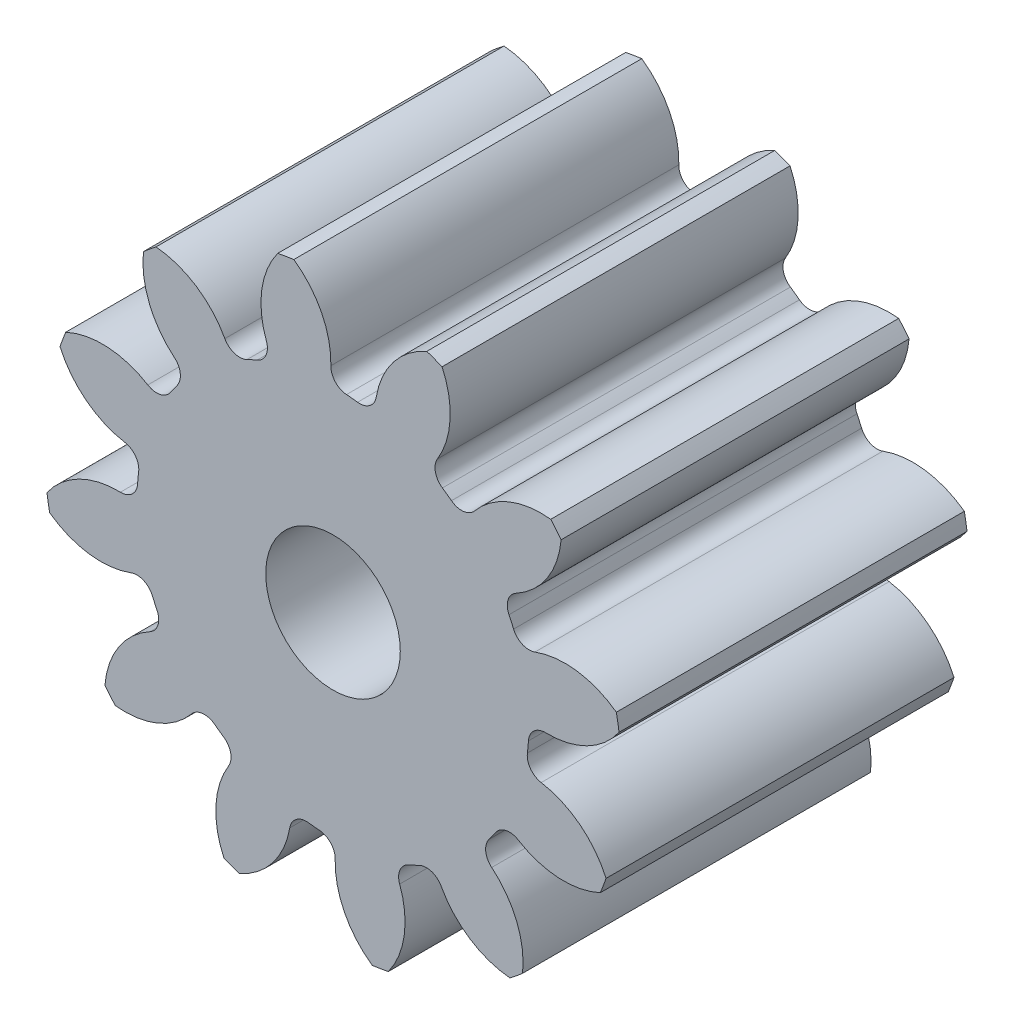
ISO-10303-21;
HEADER;
FILE_DESCRIPTION(('STEP AP214'),'2;1');
FILE_NAME('part.step','',(''),(''),'','','');
FILE_SCHEMA(('AUTOMOTIVE_DESIGN { 1 0 10303 214 1 1 1 1 }'));
ENDSEC;
DATA;
#1=APPLICATION_CONTEXT('core data for automotive mechanical design processes');
#2=APPLICATION_PROTOCOL_DEFINITION('international standard','automotive_design',2000,#1);
#3=PRODUCT_CONTEXT('',#1,'mechanical');
#4=PRODUCT('Part','Part','',(#3));
#5=PRODUCT_RELATED_PRODUCT_CATEGORY('part','',(#4));
#6=PRODUCT_DEFINITION_FORMATION('','',#4);
#7=PRODUCT_DEFINITION_CONTEXT('part definition',#1,'design');
#8=PRODUCT_DEFINITION('design','',#6,#7);
#9=PRODUCT_DEFINITION_SHAPE('','',#8);
#10=(LENGTH_UNIT() NAMED_UNIT(*) SI_UNIT(.MILLI.,.METRE.));
#11=(NAMED_UNIT(*) PLANE_ANGLE_UNIT() SI_UNIT($,.RADIAN.));
#12=(NAMED_UNIT(*) SI_UNIT($,.STERADIAN.) SOLID_ANGLE_UNIT());
#13=UNCERTAINTY_MEASURE_WITH_UNIT(LENGTH_MEASURE(1.E-05),#10,'distance_accuracy_value','');
#14=(GEOMETRIC_REPRESENTATION_CONTEXT(3) GLOBAL_UNCERTAINTY_ASSIGNED_CONTEXT((#13)) GLOBAL_UNIT_ASSIGNED_CONTEXT((#10,
#11,#12)) REPRESENTATION_CONTEXT('',''));
#15=CARTESIAN_POINT('',(0.,0.,0.));
#16=DIRECTION('',(0.,0.,1.));
#17=DIRECTION('',(1.,0.,0.));
#18=AXIS2_PLACEMENT_3D('',#15,#16,#17);
#19=CARTESIAN_POINT('',(0.,0.,95.25));
#20=DIRECTION('',(0.,0.,-1.));
#21=DIRECTION('',(-1.,0.,0.));
#22=AXIS2_PLACEMENT_3D('',#19,#20,#21);
#23=CYLINDRICAL_SURFACE('',#22,79.0222222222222);
#24=DIRECTION('',(0.,0.,-1.));
#25=VECTOR('',#24,1.);
#26=CARTESIAN_POINT('',(77.5590843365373,15.1360510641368,47.625));
#27=LINE('',#26,#25);
#28=CARTESIAN_POINT('',(77.5590843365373,15.1360510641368,95.25));
#29=VERTEX_POINT('',#28);
#30=CARTESIAN_POINT('',(77.5590843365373,15.1360510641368,0.));
#31=VERTEX_POINT('',#30);
#32=EDGE_CURVE('E528',#29,#31,#27,.T.);
#33=ORIENTED_EDGE('',*,*,#32,.F.);
#34=CARTESIAN_POINT('',(0.,0.,95.25));
#35=DIRECTION('',(0.,0.,1.));
#36=DIRECTION('',(1.,0.,0.));
#37=AXIS2_PLACEMENT_3D('',#34,#35,#36);
#38=CIRCLE('',#37,79.0222222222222);
#39=CARTESIAN_POINT('',(78.2896442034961,10.7351392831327,95.25));
#40=VERTEX_POINT('',#39);
#41=EDGE_CURVE('E945',#40,#29,#38,.T.);
#42=ORIENTED_EDGE('',*,*,#41,.F.);
#43=DIRECTION('',(0.,0.,-1.));
#44=VECTOR('',#43,1.);
#45=CARTESIAN_POINT('',(78.2896442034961,10.7351392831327,47.625));
#46=LINE('',#45,#44);
#47=CARTESIAN_POINT('',(78.2896442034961,10.7351392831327,0.));
#48=VERTEX_POINT('',#47);
#49=EDGE_CURVE('E939',#48,#40,#46,.F.);
#50=ORIENTED_EDGE('',*,*,#49,.F.);
#51=CARTESIAN_POINT('',(0.,0.,0.));
#52=DIRECTION('',(0.,0.,1.));
#53=DIRECTION('',(1.,0.,0.));
#54=AXIS2_PLACEMENT_3D('',#51,#52,#53);
#55=CIRCLE('',#54,79.0222222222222);
#56=EDGE_CURVE('E950',#48,#31,#55,.T.);
#57=ORIENTED_EDGE('',*,*,#56,.T.);
#58=EDGE_LOOP('',(#33,#42,#50,#57));
#59=FACE_BOUND('',#58,.T.);
#60=ADVANCED_FACE('F33',(#59),#23,.T.);
#61=DIRECTION('',(0.,0.,-1.));
#62=VECTOR('',#61,1.);
#63=CARTESIAN_POINT('',(62.433251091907,48.4417254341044,47.625));
#64=LINE('',#63,#62);
#65=CARTESIAN_POINT('',(62.433251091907,48.4417254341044,0.));
#66=VERTEX_POINT('',#65);
#67=CARTESIAN_POINT('',(62.433251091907,48.4417254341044,95.25));
#68=VERTEX_POINT('',#67);
#69=EDGE_CURVE('E499',#66,#68,#64,.F.);
#70=ORIENTED_EDGE('',*,*,#69,.F.);
#71=CARTESIAN_POINT('',(59.6001117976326,51.8877469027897,0.));
#72=VERTEX_POINT('',#71);
#73=EDGE_CURVE('E953',#66,#72,#55,.T.);
#74=ORIENTED_EDGE('',*,*,#73,.T.);
#75=DIRECTION('',(0.,0.,-1.));
#76=VECTOR('',#75,1.);
#77=CARTESIAN_POINT('',(59.6001117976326,51.8877469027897,47.625));
#78=LINE('',#77,#76);
#79=CARTESIAN_POINT('',(59.6001117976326,51.8877469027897,95.25));
#80=VERTEX_POINT('',#79);
#81=EDGE_CURVE('E561',#80,#72,#78,.T.);
#82=ORIENTED_EDGE('',*,*,#81,.F.);
#83=EDGE_CURVE('E948',#68,#80,#38,.T.);
#84=ORIENTED_EDGE('',*,*,#83,.F.);
#85=EDGE_LOOP('',(#70,#74,#82,#84));
#86=FACE_BOUND('',#85,.T.);
#87=ADVANCED_FACE('F1091',(#86),#23,.T.);
#88=CARTESIAN_POINT('',(0.,0.,95.25));
#89=DIRECTION('',(0.,0.,1.));
#90=DIRECTION('',(1.,0.,0.));
#91=AXIS2_PLACEMENT_3D('',#88,#89,#90);
#92=PLANE('',#91);
#93=CARTESIAN_POINT('',(0.,0.,95.2500000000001));
#94=DIRECTION('',(0.,0.,1.));
#95=DIRECTION('',(1.,0.,0.));
#96=AXIS2_PLACEMENT_3D('',#93,#94,#95);
#97=CIRCLE('',#96,18.415);
#98=CARTESIAN_POINT('',(18.415,0.,95.2499999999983));
#99=VERTEX_POINT('',#98);
#100=EDGE_CURVE('E516',#99,#99,#97,.T.);
#101=ORIENTED_EDGE('',*,*,#100,.F.);
#102=EDGE_LOOP('',(#101));
#103=FACE_BOUND('',#102,.T.);
#104=ORIENTED_EDGE('',*,*,#41,.T.);
#105=CARTESIAN_POINT('',(63.5194428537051,-4.05137657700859,95.25));
#106=DIRECTION('',(0.,0.,-1.));
#107=DIRECTION('',(0.866025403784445,0.499999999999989,0.));
#108=AXIS2_PLACEMENT_3D('',#105,#106,#107);
#109=CIRCLE('',#108,23.7753845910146);
#110=CARTESIAN_POINT('',(55.265452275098,18.2452723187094,95.25));
#111=VERTEX_POINT('',#110);
#112=EDGE_CURVE('E508',#111,#29,#109,.T.);
#113=ORIENTED_EDGE('',*,*,#112,.F.);
#114=CARTESIAN_POINT('',(53.6703739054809,22.554085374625,95.25));
#115=DIRECTION('',(0.,0.,1.));
#116=DIRECTION('',(-0.866025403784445,-0.499999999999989,0.));
#117=AXIS2_PLACEMENT_3D('',#114,#115,#116);
#118=CIRCLE('',#117,4.59457777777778);
#119=CARTESIAN_POINT('',(49.4346085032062,20.7740751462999,95.25));
#120=VERTEX_POINT('',#119);
#121=EDGE_CURVE('E506',#120,#111,#118,.T.);
#122=ORIENTED_EDGE('',*,*,#121,.F.);
#123=CARTESIAN_POINT('',(0.,0.,95.25));
#124=DIRECTION('',(0.,0.,-1.));
#125=DIRECTION('',(0.866025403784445,0.499999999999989,0.));
#126=AXIS2_PLACEMENT_3D('',#123,#124,#125);
#127=CIRCLE('',#126,53.6222222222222);
#128=CARTESIAN_POINT('',(48.1720285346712,23.5541585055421,95.25));
#129=VERTEX_POINT('',#128);
#130=EDGE_CURVE('E491',#129,#120,#127,.T.);
#131=ORIENTED_EDGE('',*,*,#130,.F.);
#132=CARTESIAN_POINT('',(52.2996107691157,25.5723779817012,95.25));
#133=DIRECTION('',(0.,0.,1.));
#134=DIRECTION('',(-0.866025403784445,-0.499999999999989,0.));
#135=AXIS2_PLACEMENT_3D('',#132,#133,#134);
#136=CIRCLE('',#135,4.59457777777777);
#137=CARTESIAN_POINT('',(50.104696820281,29.608774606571,95.25));
#138=VERTEX_POINT('',#137);
#139=EDGE_CURVE('E483',#138,#129,#136,.T.);
#140=ORIENTED_EDGE('',*,*,#139,.F.);
#141=CARTESIAN_POINT('',(38.7467601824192,50.4957606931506,95.25));
#142=DIRECTION('',(0.,0.,-1.));
#143=DIRECTION('',(-0.866025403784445,-0.499999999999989,0.));
#144=AXIS2_PLACEMENT_3D('',#141,#142,#143);
#145=CIRCLE('',#144,23.7753845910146);
#146=EDGE_CURVE('E513',#68,#138,#145,.T.);
#147=ORIENTED_EDGE('',*,*,#146,.F.);
#148=ORIENTED_EDGE('',*,*,#83,.T.);
#149=CARTESIAN_POINT('',(57.0351394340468,28.2511263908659,95.25));
#150=DIRECTION('',(0.,0.,-1.));
#151=DIRECTION('',(0.50000000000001,0.866025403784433,0.));
#152=AXIS2_PLACEMENT_3D('',#149,#150,#151);
#153=CIRCLE('',#152,23.7753845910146);
#154=CARTESIAN_POINT('',(38.7386494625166,43.4335954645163,95.25));
#155=VERTEX_POINT('',#154);
#156=EDGE_CURVE('E537',#155,#80,#153,.T.);
#157=ORIENTED_EDGE('',*,*,#156,.F.);
#158=CARTESIAN_POINT('',(35.2028645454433,46.3675978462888,95.25));
#159=DIRECTION('',(0.,0.,1.));
#160=DIRECTION('',(-0.50000000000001,-0.866025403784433,0.));
#161=AXIS2_PLACEMENT_3D('',#158,#159,#160);
#162=CIRCLE('',#161,4.59457777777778);
#163=CARTESIAN_POINT('',(32.4245892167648,42.7081810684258,95.25));
#164=VERTEX_POINT('',#163);
#165=EDGE_CURVE('E535',#164,#155,#162,.T.);
#166=ORIENTED_EDGE('',*,*,#165,.F.);
#167=CARTESIAN_POINT('',(0.,0.,95.25));
#168=DIRECTION('',(0.,0.,-1.));
#169=DIRECTION('',(0.50000000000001,0.866025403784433,0.));
#170=AXIS2_PLACEMENT_3D('',#167,#168,#169);
#171=CIRCLE('',#170,53.6222222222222);
#172=CARTESIAN_POINT('',(29.941121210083,44.4845138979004,95.25));
#173=VERTEX_POINT('',#172);
#174=EDGE_CURVE('E532',#173,#164,#171,.T.);
#175=ORIENTED_EDGE('',*,*,#174,.F.);
#176=CARTESIAN_POINT('',(32.5066025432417,48.2961343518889,95.25));
#177=DIRECTION('',(0.,0.,1.));
#178=DIRECTION('',(-0.50000000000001,-0.866025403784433,0.));
#179=AXIS2_PLACEMENT_3D('',#176,#177,#178);
#180=CIRCLE('',#179,4.59457777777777);
#181=CARTESIAN_POINT('',(28.5875529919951,50.6942993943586,95.25));
#182=VERTEX_POINT('',#181);
#183=EDGE_CURVE('E530',#182,#173,#180,.T.);
#184=ORIENTED_EDGE('',*,*,#183,.F.);
#185=CARTESIAN_POINT('',(8.30779828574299,63.1039916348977,95.25));
#186=DIRECTION('',(0.,0.,-1.));
#187=DIRECTION('',(-0.50000000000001,-0.866025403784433,0.));
#188=AXIS2_PLACEMENT_3D('',#185,#186,#187);
#189=CIRCLE('',#188,23.7753845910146);
#190=CARTESIAN_POINT('',(29.8479187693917,73.1683903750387,95.25));
#191=VERTEX_POINT('',#190);
#192=EDGE_CURVE('E540',#191,#182,#189,.T.);
#193=ORIENTED_EDGE('',*,*,#192,.F.);
#194=CARTESIAN_POINT('',(25.6713374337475,74.7361628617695,95.25));
#195=VERTEX_POINT('',#194);
#196=EDGE_CURVE('E985',#191,#195,#38,.T.);
#197=ORIENTED_EDGE('',*,*,#196,.T.);
#198=CARTESIAN_POINT('',(35.2683164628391,52.9837628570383,95.25));
#199=DIRECTION('',(0.,0.,-1.));
#200=DIRECTION('',(0.,1.,0.));
#201=AXIS2_PLACEMENT_3D('',#198,#199,#200);
#202=CIRCLE('',#201,23.7753845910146);
#203=CARTESIAN_POINT('',(11.8318568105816,56.9839217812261,95.25));
#204=VERTEX_POINT('',#203);
#205=EDGE_CURVE('E572',#204,#195,#202,.T.);
#206=ORIENTED_EDGE('',*,*,#205,.F.);
#207=CARTESIAN_POINT('',(7.302776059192,57.7569499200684,95.25));
#208=DIRECTION('',(0.,0.,1.));
#209=DIRECTION('',(0.,-1.,0.));
#210=AXIS2_PLACEMENT_3D('',#207,#208,#209);
#211=CIRCLE('',#210,4.59457777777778);
#212=CARTESIAN_POINT('',(6.7264274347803,53.1986643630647,95.25));
#213=VERTEX_POINT('',#212);
#214=EDGE_CURVE('E570',#213,#204,#211,.T.);
#215=ORIENTED_EDGE('',*,*,#214,.F.);
#216=CARTESIAN_POINT('',(0.,0.,95.25));
#217=DIRECTION('',(0.,0.,-1.));
#218=DIRECTION('',(0.,1.,0.));
#219=AXIS2_PLACEMENT_3D('',#216,#217,#218);
#220=CIRCLE('',#219,53.6222222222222);
#221=CARTESIAN_POINT('',(3.68751463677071,53.4952797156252,95.25));
#222=VERTEX_POINT('',#221);
#223=EDGE_CURVE('E567',#222,#213,#220,.T.);
#224=ORIENTED_EDGE('',*,*,#223,.F.);
#225=CARTESIAN_POINT('',(4.00347641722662,58.078980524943,95.25));
#226=DIRECTION('',(0.,0.,1.));
#227=DIRECTION('',(0.,-1.,0.));
#228=AXIS2_PLACEMENT_3D('',#225,#226,#227);
#229=CIRCLE('',#228,4.59457777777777);
#230=CARTESIAN_POINT('',(-0.589602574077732,58.1963275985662,95.25));
#231=VERTEX_POINT('',#230);
#232=EDGE_CURVE('E565',#231,#222,#229,.T.);
#233=ORIENTED_EDGE('',*,*,#232,.F.);
#234=CARTESIAN_POINT('',(-24.3572314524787,58.8035589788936,95.25));
#235=DIRECTION('',(0.,0.,-1.));
#236=DIRECTION('',(0.,-1.,0.));
#237=AXIS2_PLACEMENT_3D('',#234,#235,#236);
#238=CIRCLE('',#237,23.7753845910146);
#239=CARTESIAN_POINT('',(-10.7351392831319,78.2896442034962,95.25));
#240=VERTEX_POINT('',#239);
#241=EDGE_CURVE('E575',#240,#231,#238,.T.);
#242=ORIENTED_EDGE('',*,*,#241,.F.);
#243=CARTESIAN_POINT('',(-15.1360510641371,77.5590843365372,95.25));
#244=VERTEX_POINT('',#243);
#245=EDGE_CURVE('E1073',#240,#244,#38,.T.);
#246=ORIENTED_EDGE('',*,*,#245,.T.);
#247=CARTESIAN_POINT('',(4.05137657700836,63.5194428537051,95.25));
#248=DIRECTION('',(0.,0.,-1.));
#249=DIRECTION('',(-0.499999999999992,0.866025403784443,0.));
#250=AXIS2_PLACEMENT_3D('',#247,#248,#249);
#251=CIRCLE('',#250,23.7753845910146);
#252=CARTESIAN_POINT('',(-18.2452723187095,55.2654522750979,95.25));
#253=VERTEX_POINT('',#252);
#254=EDGE_CURVE('E610',#253,#244,#251,.T.);
#255=ORIENTED_EDGE('',*,*,#254,.F.);
#256=CARTESIAN_POINT('',(-22.5540853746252,53.6703739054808,95.25));
#257=DIRECTION('',(0.,0.,1.));
#258=DIRECTION('',(0.499999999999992,-0.866025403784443,0.));
#259=AXIS2_PLACEMENT_3D('',#256,#257,#258);
#260=CIRCLE('',#259,4.59457777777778);
#261=CARTESIAN_POINT('',(-20.7740751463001,49.4346085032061,95.25));
#262=VERTEX_POINT('',#261);
#263=EDGE_CURVE('E608',#262,#253,#260,.T.);
#264=ORIENTED_EDGE('',*,*,#263,.F.);
#265=CARTESIAN_POINT('',(0.,0.,95.25));
#266=DIRECTION('',(0.,0.,-1.));
#267=DIRECTION('',(-0.499999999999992,0.866025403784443,0.));
#268=AXIS2_PLACEMENT_3D('',#265,#266,#267);
#269=CIRCLE('',#268,53.6222222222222);
#270=CARTESIAN_POINT('',(-23.5541585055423,48.1720285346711,95.25));
#271=VERTEX_POINT('',#270);
#272=EDGE_CURVE('E605',#271,#262,#269,.T.);
#273=ORIENTED_EDGE('',*,*,#272,.F.);
#274=CARTESIAN_POINT('',(-25.5723779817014,52.2996107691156,95.25));
#275=DIRECTION('',(0.,0.,1.));
#276=DIRECTION('',(0.499999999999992,-0.866025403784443,0.));
#277=AXIS2_PLACEMENT_3D('',#274,#275,#276);
#278=CIRCLE('',#277,4.59457777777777);
#279=CARTESIAN_POINT('',(-29.6087746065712,50.1046968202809,95.25));
#280=VERTEX_POINT('',#279);
#281=EDGE_CURVE('E603',#280,#271,#278,.T.);
#282=ORIENTED_EDGE('',*,*,#281,.F.);
#283=CARTESIAN_POINT('',(-50.4957606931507,38.746760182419,95.25));
#284=DIRECTION('',(0.,0.,-1.));
#285=DIRECTION('',(0.499999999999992,-0.866025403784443,0.));
#286=AXIS2_PLACEMENT_3D('',#283,#284,#285);
#287=CIRCLE('',#286,23.7753845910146);
#288=CARTESIAN_POINT('',(-48.4417254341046,62.4332510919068,95.25));
#289=VERTEX_POINT('',#288);
#290=EDGE_CURVE('E613',#289,#280,#287,.T.);
#291=ORIENTED_EDGE('',*,*,#290,.F.);
#292=CARTESIAN_POINT('',(-51.8877469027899,59.6001117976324,95.25));
#293=VERTEX_POINT('',#292);
#294=EDGE_CURVE('E1069',#289,#293,#38,.T.);
#295=ORIENTED_EDGE('',*,*,#294,.T.);
#296=CARTESIAN_POINT('',(-28.2511263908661,57.0351394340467,95.25));
#297=DIRECTION('',(0.,0.,-1.));
#298=DIRECTION('',(-0.866025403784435,0.500000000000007,0.));
#299=AXIS2_PLACEMENT_3D('',#296,#297,#298);
#300=CIRCLE('',#299,23.7753845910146);
#301=CARTESIAN_POINT('',(-43.4335954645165,38.7386494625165,95.25));
#302=VERTEX_POINT('',#301);
#303=EDGE_CURVE('E648',#302,#293,#300,.T.);
#304=ORIENTED_EDGE('',*,*,#303,.F.);
#305=CARTESIAN_POINT('',(-46.3675978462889,35.2028645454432,95.25));
#306=DIRECTION('',(0.,0.,1.));
#307=DIRECTION('',(0.866025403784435,-0.500000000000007,0.));
#308=AXIS2_PLACEMENT_3D('',#305,#306,#307);
#309=CIRCLE('',#308,4.59457777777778);
#310=CARTESIAN_POINT('',(-42.7081810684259,32.4245892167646,95.25));
#311=VERTEX_POINT('',#310);
#312=EDGE_CURVE('E646',#311,#302,#309,.T.);
#313=ORIENTED_EDGE('',*,*,#312,.F.);
#314=CARTESIAN_POINT('',(0.,0.,95.25));
#315=DIRECTION('',(0.,0.,-1.));
#316=DIRECTION('',(-0.866025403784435,0.500000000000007,0.));
#317=AXIS2_PLACEMENT_3D('',#314,#315,#316);
#318=CIRCLE('',#317,53.6222222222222);
#319=CARTESIAN_POINT('',(-44.4845138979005,29.9411212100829,95.25));
#320=VERTEX_POINT('',#319);
#321=EDGE_CURVE('E643',#320,#311,#318,.T.);
#322=ORIENTED_EDGE('',*,*,#321,.F.);
#323=CARTESIAN_POINT('',(-48.2961343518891,32.5066025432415,95.25));
#324=DIRECTION('',(0.,0.,1.));
#325=DIRECTION('',(0.866025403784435,-0.500000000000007,0.));
#326=AXIS2_PLACEMENT_3D('',#323,#324,#325);
#327=CIRCLE('',#326,4.59457777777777);
#328=CARTESIAN_POINT('',(-50.6942993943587,28.587552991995,95.25));
#329=VERTEX_POINT('',#328);
#330=EDGE_CURVE('E641',#329,#320,#327,.T.);
#331=ORIENTED_EDGE('',*,*,#330,.F.);
#332=CARTESIAN_POINT('',(-63.1039916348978,8.30779828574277,95.25));
#333=DIRECTION('',(0.,0.,-1.));
#334=DIRECTION('',(0.866025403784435,-0.500000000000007,0.));
#335=AXIS2_PLACEMENT_3D('',#332,#333,#334);
#336=CIRCLE('',#335,23.7753845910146);
#337=CARTESIAN_POINT('',(-73.1683903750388,29.8479187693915,95.25));
#338=VERTEX_POINT('',#337);
#339=EDGE_CURVE('E651',#338,#329,#336,.T.);
#340=ORIENTED_EDGE('',*,*,#339,.F.);
#341=CARTESIAN_POINT('',(-74.7361628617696,25.6713374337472,95.25));
#342=VERTEX_POINT('',#341);
#343=EDGE_CURVE('E1065',#338,#342,#38,.T.);
#344=ORIENTED_EDGE('',*,*,#343,.T.);
#345=CARTESIAN_POINT('',(-52.9837628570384,35.2683164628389,95.25));
#346=DIRECTION('',(0.,0.,-1.));
#347=DIRECTION('',(-1.,0.,0.));
#348=AXIS2_PLACEMENT_3D('',#345,#346,#347);
#349=CIRCLE('',#348,23.7753845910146);
#350=CARTESIAN_POINT('',(-56.9839217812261,11.8318568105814,95.25));
#351=VERTEX_POINT('',#350);
#352=EDGE_CURVE('E686',#351,#342,#349,.T.);
#353=ORIENTED_EDGE('',*,*,#352,.F.);
#354=CARTESIAN_POINT('',(-57.7569499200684,7.3027760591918,95.25));
#355=DIRECTION('',(0.,0.,1.));
#356=DIRECTION('',(1.,0.,0.));
#357=AXIS2_PLACEMENT_3D('',#354,#355,#356);
#358=CIRCLE('',#357,4.59457777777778);
#359=CARTESIAN_POINT('',(-53.1986643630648,6.72642743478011,95.25));
#360=VERTEX_POINT('',#359);
#361=EDGE_CURVE('E684',#360,#351,#358,.T.);
#362=ORIENTED_EDGE('',*,*,#361,.F.);
#363=CARTESIAN_POINT('',(0.,0.,95.25));
#364=DIRECTION('',(0.,0.,-1.));
#365=DIRECTION('',(-1.,0.,0.));
#366=AXIS2_PLACEMENT_3D('',#363,#364,#365);
#367=CIRCLE('',#366,53.6222222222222);
#368=CARTESIAN_POINT('',(-53.4952797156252,3.68751463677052,95.25));
#369=VERTEX_POINT('',#368);
#370=EDGE_CURVE('E681',#369,#360,#367,.T.);
#371=ORIENTED_EDGE('',*,*,#370,.F.);
#372=CARTESIAN_POINT('',(-58.078980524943,4.00347641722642,95.25));
#373=DIRECTION('',(0.,0.,1.));
#374=DIRECTION('',(1.,0.,0.));
#375=AXIS2_PLACEMENT_3D('',#372,#373,#374);
#376=CIRCLE('',#375,4.59457777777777);
#377=CARTESIAN_POINT('',(-58.1963275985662,-0.589602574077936,95.25));
#378=VERTEX_POINT('',#377);
#379=EDGE_CURVE('E679',#378,#369,#376,.T.);
#380=ORIENTED_EDGE('',*,*,#379,.F.);
#381=CARTESIAN_POINT('',(-58.8035589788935,-24.3572314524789,95.25));
#382=DIRECTION('',(0.,0.,-1.));
#383=DIRECTION('',(1.,0.,0.));
#384=AXIS2_PLACEMENT_3D('',#381,#382,#383);
#385=CIRCLE('',#384,23.7753845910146);
#386=CARTESIAN_POINT('',(-78.2896442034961,-10.7351392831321,95.25));
#387=VERTEX_POINT('',#386);
#388=EDGE_CURVE('E689',#387,#378,#385,.T.);
#389=ORIENTED_EDGE('',*,*,#388,.F.);
#390=CARTESIAN_POINT('',(-77.5590843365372,-15.1360510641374,95.25));
#391=VERTEX_POINT('',#390);
#392=EDGE_CURVE('E1061',#387,#391,#38,.T.);
#393=ORIENTED_EDGE('',*,*,#392,.T.);
#394=CARTESIAN_POINT('',(-63.5194428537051,4.05137657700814,95.25));
#395=DIRECTION('',(0.,0.,-1.));
#396=DIRECTION('',(-0.866025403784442,-0.499999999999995,0.));
#397=AXIS2_PLACEMENT_3D('',#394,#395,#396);
#398=CIRCLE('',#397,23.7753845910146);
#399=CARTESIAN_POINT('',(-55.2654522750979,-18.2452723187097,95.25));
#400=VERTEX_POINT('',#399);
#401=EDGE_CURVE('E724',#400,#391,#398,.T.);
#402=ORIENTED_EDGE('',*,*,#401,.F.);
#403=CARTESIAN_POINT('',(-53.6703739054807,-22.5540853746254,95.25));
#404=DIRECTION('',(0.,0.,1.));
#405=DIRECTION('',(0.866025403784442,0.499999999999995,0.));
#406=AXIS2_PLACEMENT_3D('',#403,#404,#405);
#407=CIRCLE('',#406,4.59457777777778);
#408=CARTESIAN_POINT('',(-49.434608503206,-20.7740751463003,95.25));
#409=VERTEX_POINT('',#408);
#410=EDGE_CURVE('E722',#409,#400,#407,.T.);
#411=ORIENTED_EDGE('',*,*,#410,.F.);
#412=CARTESIAN_POINT('',(0.,0.,95.25));
#413=DIRECTION('',(0.,0.,-1.));
#414=DIRECTION('',(-0.866025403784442,-0.499999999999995,0.));
#415=AXIS2_PLACEMENT_3D('',#412,#413,#414);
#416=CIRCLE('',#415,53.6222222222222);
#417=CARTESIAN_POINT('',(-48.172028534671,-23.5541585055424,95.25));
#418=VERTEX_POINT('',#417);
#419=EDGE_CURVE('E719',#418,#409,#416,.T.);
#420=ORIENTED_EDGE('',*,*,#419,.F.);
#421=CARTESIAN_POINT('',(-52.2996107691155,-25.5723779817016,95.25));
#422=DIRECTION('',(0.,0.,1.));
#423=DIRECTION('',(0.866025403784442,0.499999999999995,0.));
#424=AXIS2_PLACEMENT_3D('',#421,#422,#423);
#425=CIRCLE('',#424,4.59457777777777);
#426=CARTESIAN_POINT('',(-50.1046968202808,-29.6087746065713,95.25));
#427=VERTEX_POINT('',#426);
#428=EDGE_CURVE('E717',#427,#418,#425,.T.);
#429=ORIENTED_EDGE('',*,*,#428,.F.);
#430=CARTESIAN_POINT('',(-38.7467601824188,-50.4957606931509,95.25));
#431=DIRECTION('',(0.,0.,-1.));
#432=DIRECTION('',(0.866025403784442,0.499999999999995,0.));
#433=AXIS2_PLACEMENT_3D('',#430,#431,#432);
#434=CIRCLE('',#433,23.7753845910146);
#435=CARTESIAN_POINT('',(-62.4332510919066,-48.4417254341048,95.25));
#436=VERTEX_POINT('',#435);
#437=EDGE_CURVE('E727',#436,#427,#434,.T.);
#438=ORIENTED_EDGE('',*,*,#437,.F.);
#439=CARTESIAN_POINT('',(-59.6001117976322,-51.8877469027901,95.25));
#440=VERTEX_POINT('',#439);
#441=EDGE_CURVE('E1057',#436,#440,#38,.T.);
#442=ORIENTED_EDGE('',*,*,#441,.T.);
#443=CARTESIAN_POINT('',(-57.0351394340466,-28.2511263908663,95.25));
#444=DIRECTION('',(0.,0.,-1.));
#445=DIRECTION('',(-0.500000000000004,-0.866025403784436,0.));
#446=AXIS2_PLACEMENT_3D('',#443,#444,#445);
#447=CIRCLE('',#446,23.7753845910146);
#448=CARTESIAN_POINT('',(-38.7386494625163,-43.4335954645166,95.25));
#449=VERTEX_POINT('',#448);
#450=EDGE_CURVE('E762',#449,#440,#447,.T.);
#451=ORIENTED_EDGE('',*,*,#450,.F.);
#452=CARTESIAN_POINT('',(-35.202864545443,-46.367597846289,95.25));
#453=DIRECTION('',(0.,0.,1.));
#454=DIRECTION('',(0.500000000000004,0.866025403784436,0.));
#455=AXIS2_PLACEMENT_3D('',#452,#453,#454);
#456=CIRCLE('',#455,4.59457777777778);
#457=CARTESIAN_POINT('',(-32.4245892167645,-42.708181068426,95.25));
#458=VERTEX_POINT('',#457);
#459=EDGE_CURVE('E760',#458,#449,#456,.T.);
#460=ORIENTED_EDGE('',*,*,#459,.F.);
#461=CARTESIAN_POINT('',(0.,0.,95.25));
#462=DIRECTION('',(0.,0.,-1.));
#463=DIRECTION('',(-0.500000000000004,-0.866025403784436,0.));
#464=AXIS2_PLACEMENT_3D('',#461,#462,#463);
#465=CIRCLE('',#464,53.6222222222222);
#466=CARTESIAN_POINT('',(-29.9411212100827,-44.4845138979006,95.25));
#467=VERTEX_POINT('',#466);
#468=EDGE_CURVE('E757',#467,#458,#465,.T.);
#469=ORIENTED_EDGE('',*,*,#468,.F.);
#470=CARTESIAN_POINT('',(-32.5066025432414,-48.2961343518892,95.25));
#471=DIRECTION('',(0.,0.,1.));
#472=DIRECTION('',(0.500000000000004,0.866025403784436,0.));
#473=AXIS2_PLACEMENT_3D('',#470,#471,#472);
#474=CIRCLE('',#473,4.59457777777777);
#475=CARTESIAN_POINT('',(-28.5875529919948,-50.6942993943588,95.25));
#476=VERTEX_POINT('',#475);
#477=EDGE_CURVE('E755',#476,#467,#474,.T.);
#478=ORIENTED_EDGE('',*,*,#477,.F.);
#479=CARTESIAN_POINT('',(-8.30779828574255,-63.1039916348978,95.25));
#480=DIRECTION('',(0.,0.,-1.));
#481=DIRECTION('',(0.500000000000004,0.866025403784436,0.));
#482=AXIS2_PLACEMENT_3D('',#479,#480,#481);
#483=CIRCLE('',#482,23.7753845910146);
#484=CARTESIAN_POINT('',(-29.8479187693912,-73.1683903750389,95.25));
#485=VERTEX_POINT('',#484);
#486=EDGE_CURVE('E765',#485,#476,#483,.T.);
#487=ORIENTED_EDGE('',*,*,#486,.F.);
#488=CARTESIAN_POINT('',(-25.671337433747,-74.7361628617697,95.25));
#489=VERTEX_POINT('',#488);
#490=EDGE_CURVE('E1053',#485,#489,#38,.T.);
#491=ORIENTED_EDGE('',*,*,#490,.T.);
#492=CARTESIAN_POINT('',(-35.2683164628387,-52.9837628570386,95.25));
#493=DIRECTION('',(0.,0.,-1.));
#494=DIRECTION('',(0.,-1.,0.));
#495=AXIS2_PLACEMENT_3D('',#492,#493,#494);
#496=CIRCLE('',#495,23.7753845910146);
#497=CARTESIAN_POINT('',(-11.8318568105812,-56.9839217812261,95.25));
#498=VERTEX_POINT('',#497);
#499=EDGE_CURVE('E800',#498,#489,#496,.T.);
#500=ORIENTED_EDGE('',*,*,#499,.F.);
#501=CARTESIAN_POINT('',(-7.3027760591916,-57.7569499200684,95.25));
#502=DIRECTION('',(0.,0.,1.));
#503=DIRECTION('',(0.,1.,0.));
#504=AXIS2_PLACEMENT_3D('',#501,#502,#503);
#505=CIRCLE('',#504,4.59457777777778);
#506=CARTESIAN_POINT('',(-6.72642743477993,-53.1986643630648,95.25));
#507=VERTEX_POINT('',#506);
#508=EDGE_CURVE('E798',#507,#498,#505,.T.);
#509=ORIENTED_EDGE('',*,*,#508,.F.);
#510=CARTESIAN_POINT('',(0.,0.,95.25));
#511=DIRECTION('',(0.,0.,-1.));
#512=DIRECTION('',(0.,-1.,0.));
#513=AXIS2_PLACEMENT_3D('',#510,#511,#512);
#514=CIRCLE('',#513,53.6222222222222);
#515=CARTESIAN_POINT('',(-3.68751463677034,-53.4952797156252,95.25));
#516=VERTEX_POINT('',#515);
#517=EDGE_CURVE('E795',#516,#507,#514,.T.);
#518=ORIENTED_EDGE('',*,*,#517,.F.);
#519=CARTESIAN_POINT('',(-4.00347641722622,-58.078980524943,95.25));
#520=DIRECTION('',(0.,0.,1.));
#521=DIRECTION('',(0.,1.,0.));
#522=AXIS2_PLACEMENT_3D('',#519,#520,#521);
#523=CIRCLE('',#522,4.59457777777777);
#524=CARTESIAN_POINT('',(0.589602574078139,-58.1963275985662,95.25));
#525=VERTEX_POINT('',#524);
#526=EDGE_CURVE('E793',#525,#516,#523,.T.);
#527=ORIENTED_EDGE('',*,*,#526,.F.);
#528=CARTESIAN_POINT('',(24.3572314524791,-58.8035589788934,95.25));
#529=DIRECTION('',(0.,0.,-1.));
#530=DIRECTION('',(0.,1.,0.));
#531=AXIS2_PLACEMENT_3D('',#528,#529,#530);
#532=CIRCLE('',#531,23.7753845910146);
#533=CARTESIAN_POINT('',(10.7351392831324,-78.2896442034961,95.25));
#534=VERTEX_POINT('',#533);
#535=EDGE_CURVE('E803',#534,#525,#532,.T.);
#536=ORIENTED_EDGE('',*,*,#535,.F.);
#537=CARTESIAN_POINT('',(15.1360510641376,-77.5590843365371,95.25));
#538=VERTEX_POINT('',#537);
#539=EDGE_CURVE('E1049',#534,#538,#38,.T.);
#540=ORIENTED_EDGE('',*,*,#539,.T.);
#541=CARTESIAN_POINT('',(-4.05137657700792,-63.5194428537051,95.25));
#542=DIRECTION('',(0.,0.,-1.));
#543=DIRECTION('',(0.499999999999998,-0.86602540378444,0.));
#544=AXIS2_PLACEMENT_3D('',#541,#542,#543);
#545=CIRCLE('',#544,23.7753845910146);
#546=CARTESIAN_POINT('',(18.2452723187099,-55.2654522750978,95.25));
#547=VERTEX_POINT('',#546);
#548=EDGE_CURVE('E838',#547,#538,#545,.T.);
#549=ORIENTED_EDGE('',*,*,#548,.F.);
#550=CARTESIAN_POINT('',(22.5540853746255,-53.6703739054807,95.25));
#551=DIRECTION('',(0.,0.,1.));
#552=DIRECTION('',(-0.499999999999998,0.86602540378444,0.));
#553=AXIS2_PLACEMENT_3D('',#550,#551,#552);
#554=CIRCLE('',#553,4.59457777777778);
#555=CARTESIAN_POINT('',(20.7740751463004,-49.434608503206,95.25));
#556=VERTEX_POINT('',#555);
#557=EDGE_CURVE('E836',#556,#547,#554,.T.);
#558=ORIENTED_EDGE('',*,*,#557,.F.);
#559=CARTESIAN_POINT('',(0.,0.,95.25));
#560=DIRECTION('',(0.,0.,-1.));
#561=DIRECTION('',(0.499999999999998,-0.86602540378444,0.));
#562=AXIS2_PLACEMENT_3D('',#559,#560,#561);
#563=CIRCLE('',#562,53.6222222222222);
#564=CARTESIAN_POINT('',(23.5541585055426,-48.172028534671,95.25));
#565=VERTEX_POINT('',#564);
#566=EDGE_CURVE('E833',#565,#556,#563,.T.);
#567=ORIENTED_EDGE('',*,*,#566,.F.);
#568=CARTESIAN_POINT('',(25.5723779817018,-52.2996107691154,95.25));
#569=DIRECTION('',(0.,0.,1.));
#570=DIRECTION('',(-0.499999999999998,0.86602540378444,0.));
#571=AXIS2_PLACEMENT_3D('',#568,#569,#570);
#572=CIRCLE('',#571,4.59457777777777);
#573=CARTESIAN_POINT('',(29.6087746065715,-50.1046968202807,95.25));
#574=VERTEX_POINT('',#573);
#575=EDGE_CURVE('E831',#574,#565,#572,.T.);
#576=ORIENTED_EDGE('',*,*,#575,.F.);
#577=CARTESIAN_POINT('',(50.495760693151,-38.7467601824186,95.25));
#578=DIRECTION('',(0.,0.,-1.));
#579=DIRECTION('',(-0.499999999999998,0.86602540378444,0.));
#580=AXIS2_PLACEMENT_3D('',#577,#578,#579);
#581=CIRCLE('',#580,23.7753845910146);
#582=CARTESIAN_POINT('',(48.4417254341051,-62.4332510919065,95.25));
#583=VERTEX_POINT('',#582);
#584=EDGE_CURVE('E841',#583,#574,#581,.T.);
#585=ORIENTED_EDGE('',*,*,#584,.F.);
#586=CARTESIAN_POINT('',(51.8877469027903,-59.600111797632,95.25));
#587=VERTEX_POINT('',#586);
#588=EDGE_CURVE('E1048',#583,#587,#38,.T.);
#589=ORIENTED_EDGE('',*,*,#588,.T.);
#590=CARTESIAN_POINT('',(28.2511263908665,-57.0351394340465,95.25));
#591=DIRECTION('',(0.,0.,-1.));
#592=DIRECTION('',(0.866025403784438,-0.500000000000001,0.));
#593=AXIS2_PLACEMENT_3D('',#590,#591,#592);
#594=CIRCLE('',#593,23.7753845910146);
#595=CARTESIAN_POINT('',(43.4335954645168,-38.7386494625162,95.25));
#596=VERTEX_POINT('',#595);
#597=EDGE_CURVE('E876',#596,#587,#594,.T.);
#598=ORIENTED_EDGE('',*,*,#597,.F.);
#599=CARTESIAN_POINT('',(46.3675978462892,-35.2028645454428,95.25));
#600=DIRECTION('',(0.,0.,1.));
#601=DIRECTION('',(-0.866025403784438,0.500000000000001,0.));
#602=AXIS2_PLACEMENT_3D('',#599,#600,#601);
#603=CIRCLE('',#602,4.59457777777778);
#604=CARTESIAN_POINT('',(42.7081810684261,-32.4245892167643,95.25));
#605=VERTEX_POINT('',#604);
#606=EDGE_CURVE('E874',#605,#596,#603,.T.);
#607=ORIENTED_EDGE('',*,*,#606,.F.);
#608=CARTESIAN_POINT('',(0.,0.,95.25));
#609=DIRECTION('',(0.,0.,-1.));
#610=DIRECTION('',(0.866025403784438,-0.500000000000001,0.));
#611=AXIS2_PLACEMENT_3D('',#608,#609,#610);
#612=CIRCLE('',#611,53.6222222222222);
#613=CARTESIAN_POINT('',(44.4845138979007,-29.9411212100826,95.25));
#614=VERTEX_POINT('',#613);
#615=EDGE_CURVE('E871',#614,#605,#612,.T.);
#616=ORIENTED_EDGE('',*,*,#615,.F.);
#617=CARTESIAN_POINT('',(48.2961343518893,-32.5066025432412,95.25));
#618=DIRECTION('',(0.,0.,1.));
#619=DIRECTION('',(-0.866025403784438,0.500000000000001,0.));
#620=AXIS2_PLACEMENT_3D('',#617,#618,#619);
#621=CIRCLE('',#620,4.59457777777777);
#622=CARTESIAN_POINT('',(50.6942993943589,-28.5875529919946,95.25));
#623=VERTEX_POINT('',#622);
#624=EDGE_CURVE('E869',#623,#614,#621,.T.);
#625=ORIENTED_EDGE('',*,*,#624,.F.);
#626=CARTESIAN_POINT('',(63.1039916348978,-8.30779828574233,95.25));
#627=DIRECTION('',(0.,0.,-1.));
#628=DIRECTION('',(-0.866025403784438,0.500000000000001,0.));
#629=AXIS2_PLACEMENT_3D('',#626,#627,#628);
#630=CIRCLE('',#629,23.7753845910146);
#631=CARTESIAN_POINT('',(73.168390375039,-29.8479187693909,95.25));
#632=VERTEX_POINT('',#631);
#633=EDGE_CURVE('E879',#632,#623,#630,.T.);
#634=ORIENTED_EDGE('',*,*,#633,.F.);
#635=CARTESIAN_POINT('',(74.7361628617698,-25.6713374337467,95.25));
#636=VERTEX_POINT('',#635);
#637=EDGE_CURVE('E949',#632,#636,#38,.T.);
#638=ORIENTED_EDGE('',*,*,#637,.T.);
#639=CARTESIAN_POINT('',(52.9837628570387,-35.2683164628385,95.25));
#640=DIRECTION('',(0.,0.,-1.));
#641=DIRECTION('',(1.,0.,0.));
#642=AXIS2_PLACEMENT_3D('',#639,#640,#641);
#643=CIRCLE('',#642,23.7753845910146);
#644=CARTESIAN_POINT('',(56.9839217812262,-11.831856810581,95.25));
#645=VERTEX_POINT('',#644);
#646=EDGE_CURVE('E914',#645,#636,#643,.T.);
#647=ORIENTED_EDGE('',*,*,#646,.F.);
#648=CARTESIAN_POINT('',(57.7569499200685,-7.3027760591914,95.25));
#649=DIRECTION('',(0.,0.,1.));
#650=DIRECTION('',(-1.,0.,0.));
#651=AXIS2_PLACEMENT_3D('',#648,#649,#650);
#652=CIRCLE('',#651,4.59457777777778);
#653=CARTESIAN_POINT('',(53.1986643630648,-6.72642743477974,95.25));
#654=VERTEX_POINT('',#653);
#655=EDGE_CURVE('E912',#654,#645,#652,.T.);
#656=ORIENTED_EDGE('',*,*,#655,.F.);
#657=CARTESIAN_POINT('',(0.,0.,95.25));
#658=DIRECTION('',(0.,0.,-1.));
#659=DIRECTION('',(1.,0.,0.));
#660=AXIS2_PLACEMENT_3D('',#657,#658,#659);
#661=CIRCLE('',#660,53.6222222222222);
#662=CARTESIAN_POINT('',(53.4952797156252,-3.68751463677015,95.25));
#663=VERTEX_POINT('',#662);
#664=EDGE_CURVE('E909',#663,#654,#661,.T.);
#665=ORIENTED_EDGE('',*,*,#664,.F.);
#666=CARTESIAN_POINT('',(58.078980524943,-4.00347641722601,95.25));
#667=DIRECTION('',(0.,0.,1.));
#668=DIRECTION('',(-1.,0.,0.));
#669=AXIS2_PLACEMENT_3D('',#666,#667,#668);
#670=CIRCLE('',#669,4.59457777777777);
#671=CARTESIAN_POINT('',(58.1963275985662,0.589602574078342,95.25));
#672=VERTEX_POINT('',#671);
#673=EDGE_CURVE('E907',#672,#663,#670,.T.);
#674=ORIENTED_EDGE('',*,*,#673,.F.);
#675=CARTESIAN_POINT('',(58.8035589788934,24.3572314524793,95.25));
#676=DIRECTION('',(0.,0.,-1.));
#677=DIRECTION('',(-1.,0.,0.));
#678=AXIS2_PLACEMENT_3D('',#675,#676,#677);
#679=CIRCLE('',#678,23.7753845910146);
#680=EDGE_CURVE('E917',#40,#672,#679,.T.);
#681=ORIENTED_EDGE('',*,*,#680,.F.);
#682=EDGE_LOOP('',(#104,#113,#122,#131,#140,#147,#148,#157,#166,#175,#184,#193,#197,#206,#215,
#224,#233,#242,#246,#255,#264,#273,#282,#291,#295,#304,#313,#322,#331,#340,#344,#353,#362,#371,
#380,#389,#393,#402,#411,#420,#429,#438,#442,#451,#460,#469,#478,#487,#491,#500,#509,#518,#527,
#536,#540,#549,#558,#567,#576,#585,#589,#598,#607,#616,#625,#634,#638,#647,#656,#665,#674,#681));
#683=FACE_BOUND('',#682,.T.);
#684=ADVANCED_FACE('F504',(#103,#683),#92,.T.);
#685=CARTESIAN_POINT('',(0.,0.,0.));
#686=DIRECTION('',(0.,0.,1.));
#687=DIRECTION('',(1.,0.,0.));
#688=AXIS2_PLACEMENT_3D('',#685,#686,#687);
#689=PLANE('',#688);
#690=CARTESIAN_POINT('',(0.,0.,0.));
#691=DIRECTION('',(0.,0.,1.));
#692=DIRECTION('',(1.,0.,0.));
#693=AXIS2_PLACEMENT_3D('',#690,#691,#692);
#694=CIRCLE('',#693,18.415);
#695=CARTESIAN_POINT('',(18.415,0.,-1.77635683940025E-12));
#696=VERTEX_POINT('',#695);
#697=EDGE_CURVE('E36',#696,#696,#694,.T.);
#698=ORIENTED_EDGE('',*,*,#697,.T.);
#699=EDGE_LOOP('',(#698));
#700=FACE_BOUND('',#699,.T.);
#701=CARTESIAN_POINT('',(63.5194428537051,-4.05137657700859,0.));
#702=DIRECTION('',(0.,0.,-1.));
#703=DIRECTION('',(0.866025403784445,0.499999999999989,0.));
#704=AXIS2_PLACEMENT_3D('',#701,#702,#703);
#705=CIRCLE('',#704,23.7753845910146);
#706=CARTESIAN_POINT('',(55.265452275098,18.2452723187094,0.));
#707=VERTEX_POINT('',#706);
#708=EDGE_CURVE('E492',#707,#31,#705,.T.);
#709=ORIENTED_EDGE('',*,*,#708,.T.);
#710=ORIENTED_EDGE('',*,*,#56,.F.);
#711=CARTESIAN_POINT('',(58.8035589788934,24.3572314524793,0.));
#712=DIRECTION('',(0.,0.,1.));
#713=DIRECTION('',(1.,0.,0.));
#714=AXIS2_PLACEMENT_3D('',#711,#712,#713);
#715=CIRCLE('',#714,23.7753845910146);
#716=CARTESIAN_POINT('',(58.1963275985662,0.589602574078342,0.));
#717=VERTEX_POINT('',#716);
#718=EDGE_CURVE('E947',#717,#48,#715,.T.);
#719=ORIENTED_EDGE('',*,*,#718,.F.);
#720=CARTESIAN_POINT('',(58.078980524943,-4.00347641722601,0.));
#721=DIRECTION('',(0.,0.,1.));
#722=DIRECTION('',(-1.,0.,0.));
#723=AXIS2_PLACEMENT_3D('',#720,#721,#722);
#724=CIRCLE('',#723,4.59457777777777);
#725=CARTESIAN_POINT('',(53.4952797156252,-3.68751463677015,0.));
#726=VERTEX_POINT('',#725);
#727=EDGE_CURVE('E906',#717,#726,#724,.T.);
#728=ORIENTED_EDGE('',*,*,#727,.T.);
#729=CARTESIAN_POINT('',(0.,0.,0.));
#730=DIRECTION('',(0.,0.,-1.));
#731=DIRECTION('',(1.,0.,0.));
#732=AXIS2_PLACEMENT_3D('',#729,#730,#731);
#733=CIRCLE('',#732,53.6222222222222);
#734=CARTESIAN_POINT('',(53.1986643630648,-6.72642743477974,0.));
#735=VERTEX_POINT('',#734);
#736=EDGE_CURVE('E922',#726,#735,#733,.T.);
#737=ORIENTED_EDGE('',*,*,#736,.T.);
#738=CARTESIAN_POINT('',(57.7569499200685,-7.3027760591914,0.));
#739=DIRECTION('',(0.,0.,1.));
#740=DIRECTION('',(-1.,0.,0.));
#741=AXIS2_PLACEMENT_3D('',#738,#739,#740);
#742=CIRCLE('',#741,4.59457777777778);
#743=CARTESIAN_POINT('',(56.9839217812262,-11.831856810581,0.));
#744=VERTEX_POINT('',#743);
#745=EDGE_CURVE('E925',#735,#744,#742,.T.);
#746=ORIENTED_EDGE('',*,*,#745,.T.);
#747=CARTESIAN_POINT('',(52.9837628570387,-35.2683164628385,0.));
#748=DIRECTION('',(0.,0.,-1.));
#749=DIRECTION('',(1.,0.,0.));
#750=AXIS2_PLACEMENT_3D('',#747,#748,#749);
#751=CIRCLE('',#750,23.7753845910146);
#752=CARTESIAN_POINT('',(74.7361628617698,-25.6713374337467,0.));
#753=VERTEX_POINT('',#752);
#754=EDGE_CURVE('E910',#744,#753,#751,.T.);
#755=ORIENTED_EDGE('',*,*,#754,.T.);
#756=CARTESIAN_POINT('',(73.168390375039,-29.8479187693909,0.));
#757=VERTEX_POINT('',#756);
#758=EDGE_CURVE('E944',#757,#753,#55,.T.);
#759=ORIENTED_EDGE('',*,*,#758,.F.);
#760=CARTESIAN_POINT('',(63.1039916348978,-8.30779828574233,0.));
#761=DIRECTION('',(0.,0.,1.));
#762=DIRECTION('',(1.,0.,0.));
#763=AXIS2_PLACEMENT_3D('',#760,#761,#762);
#764=CIRCLE('',#763,23.7753845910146);
#765=CARTESIAN_POINT('',(50.6942993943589,-28.5875529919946,0.));
#766=VERTEX_POINT('',#765);
#767=EDGE_CURVE('E955',#766,#757,#764,.T.);
#768=ORIENTED_EDGE('',*,*,#767,.F.);
#769=CARTESIAN_POINT('',(48.2961343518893,-32.5066025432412,0.));
#770=DIRECTION('',(0.,0.,1.));
#771=DIRECTION('',(-0.866025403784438,0.500000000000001,0.));
#772=AXIS2_PLACEMENT_3D('',#769,#770,#771);
#773=CIRCLE('',#772,4.59457777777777);
#774=CARTESIAN_POINT('',(44.4845138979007,-29.9411212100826,0.));
#775=VERTEX_POINT('',#774);
#776=EDGE_CURVE('E868',#766,#775,#773,.T.);
#777=ORIENTED_EDGE('',*,*,#776,.T.);
#778=CARTESIAN_POINT('',(0.,0.,0.));
#779=DIRECTION('',(0.,0.,-1.));
#780=DIRECTION('',(0.866025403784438,-0.500000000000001,0.));
#781=AXIS2_PLACEMENT_3D('',#778,#779,#780);
#782=CIRCLE('',#781,53.6222222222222);
#783=CARTESIAN_POINT('',(42.7081810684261,-32.4245892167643,0.));
#784=VERTEX_POINT('',#783);
#785=EDGE_CURVE('E884',#775,#784,#782,.T.);
#786=ORIENTED_EDGE('',*,*,#785,.T.);
#787=CARTESIAN_POINT('',(46.3675978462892,-35.2028645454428,0.));
#788=DIRECTION('',(0.,0.,1.));
#789=DIRECTION('',(-0.866025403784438,0.500000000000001,0.));
#790=AXIS2_PLACEMENT_3D('',#787,#788,#789);
#791=CIRCLE('',#790,4.59457777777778);
#792=CARTESIAN_POINT('',(43.4335954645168,-38.7386494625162,0.));
#793=VERTEX_POINT('',#792);
#794=EDGE_CURVE('E887',#784,#793,#791,.T.);
#795=ORIENTED_EDGE('',*,*,#794,.T.);
#796=CARTESIAN_POINT('',(28.2511263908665,-57.0351394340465,0.));
#797=DIRECTION('',(0.,0.,-1.));
#798=DIRECTION('',(0.866025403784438,-0.500000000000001,0.));
#799=AXIS2_PLACEMENT_3D('',#796,#797,#798);
#800=CIRCLE('',#799,23.7753845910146);
#801=CARTESIAN_POINT('',(51.8877469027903,-59.600111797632,0.));
#802=VERTEX_POINT('',#801);
#803=EDGE_CURVE('E872',#793,#802,#800,.T.);
#804=ORIENTED_EDGE('',*,*,#803,.T.);
#805=CARTESIAN_POINT('',(48.4417254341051,-62.4332510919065,0.));
#806=VERTEX_POINT('',#805);
#807=EDGE_CURVE('E1019',#806,#802,#55,.T.);
#808=ORIENTED_EDGE('',*,*,#807,.F.);
#809=CARTESIAN_POINT('',(50.495760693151,-38.7467601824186,0.));
#810=DIRECTION('',(0.,0.,1.));
#811=DIRECTION('',(1.,0.,0.));
#812=AXIS2_PLACEMENT_3D('',#809,#810,#811);
#813=CIRCLE('',#812,23.7753845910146);
#814=CARTESIAN_POINT('',(29.6087746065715,-50.1046968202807,0.));
#815=VERTEX_POINT('',#814);
#816=EDGE_CURVE('E957',#815,#806,#813,.T.);
#817=ORIENTED_EDGE('',*,*,#816,.F.);
#818=CARTESIAN_POINT('',(25.5723779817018,-52.2996107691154,0.));
#819=DIRECTION('',(0.,0.,1.));
#820=DIRECTION('',(-0.499999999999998,0.86602540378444,0.));
#821=AXIS2_PLACEMENT_3D('',#818,#819,#820);
#822=CIRCLE('',#821,4.59457777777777);
#823=CARTESIAN_POINT('',(23.5541585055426,-48.172028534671,0.));
#824=VERTEX_POINT('',#823);
#825=EDGE_CURVE('E830',#815,#824,#822,.T.);
#826=ORIENTED_EDGE('',*,*,#825,.T.);
#827=CARTESIAN_POINT('',(0.,0.,0.));
#828=DIRECTION('',(0.,0.,-1.));
#829=DIRECTION('',(0.499999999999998,-0.86602540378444,0.));
#830=AXIS2_PLACEMENT_3D('',#827,#828,#829);
#831=CIRCLE('',#830,53.6222222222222);
#832=CARTESIAN_POINT('',(20.7740751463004,-49.434608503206,0.));
#833=VERTEX_POINT('',#832);
#834=EDGE_CURVE('E846',#824,#833,#831,.T.);
#835=ORIENTED_EDGE('',*,*,#834,.T.);
#836=CARTESIAN_POINT('',(22.5540853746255,-53.6703739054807,0.));
#837=DIRECTION('',(0.,0.,1.));
#838=DIRECTION('',(-0.499999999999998,0.86602540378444,0.));
#839=AXIS2_PLACEMENT_3D('',#836,#837,#838);
#840=CIRCLE('',#839,4.59457777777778);
#841=CARTESIAN_POINT('',(18.2452723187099,-55.2654522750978,0.));
#842=VERTEX_POINT('',#841);
#843=EDGE_CURVE('E849',#833,#842,#840,.T.);
#844=ORIENTED_EDGE('',*,*,#843,.T.);
#845=CARTESIAN_POINT('',(-4.05137657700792,-63.5194428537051,0.));
#846=DIRECTION('',(0.,0.,-1.));
#847=DIRECTION('',(0.499999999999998,-0.86602540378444,0.));
#848=AXIS2_PLACEMENT_3D('',#845,#846,#847);
#849=CIRCLE('',#848,23.7753845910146);
#850=CARTESIAN_POINT('',(15.1360510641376,-77.5590843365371,0.));
#851=VERTEX_POINT('',#850);
#852=EDGE_CURVE('E834',#842,#851,#849,.T.);
#853=ORIENTED_EDGE('',*,*,#852,.T.);
#854=CARTESIAN_POINT('',(10.7351392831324,-78.2896442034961,0.));
#855=VERTEX_POINT('',#854);
#856=EDGE_CURVE('E1014',#855,#851,#55,.T.);
#857=ORIENTED_EDGE('',*,*,#856,.F.);
#858=CARTESIAN_POINT('',(24.3572314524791,-58.8035589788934,0.));
#859=DIRECTION('',(0.,0.,1.));
#860=DIRECTION('',(1.,0.,0.));
#861=AXIS2_PLACEMENT_3D('',#858,#859,#860);
#862=CIRCLE('',#861,23.7753845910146);
#863=CARTESIAN_POINT('',(0.589602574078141,-58.1963275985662,0.));
#864=VERTEX_POINT('',#863);
#865=EDGE_CURVE('E959',#864,#855,#862,.T.);
#866=ORIENTED_EDGE('',*,*,#865,.F.);
#867=CARTESIAN_POINT('',(-4.00347641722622,-58.078980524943,0.));
#868=DIRECTION('',(0.,0.,1.));
#869=DIRECTION('',(0.,1.,0.));
#870=AXIS2_PLACEMENT_3D('',#867,#868,#869);
#871=CIRCLE('',#870,4.59457777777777);
#872=CARTESIAN_POINT('',(-3.68751463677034,-53.4952797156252,0.));
#873=VERTEX_POINT('',#872);
#874=EDGE_CURVE('E792',#864,#873,#871,.T.);
#875=ORIENTED_EDGE('',*,*,#874,.T.);
#876=CARTESIAN_POINT('',(0.,0.,0.));
#877=DIRECTION('',(0.,0.,-1.));
#878=DIRECTION('',(0.,-1.,0.));
#879=AXIS2_PLACEMENT_3D('',#876,#877,#878);
#880=CIRCLE('',#879,53.6222222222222);
#881=CARTESIAN_POINT('',(-6.72642743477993,-53.1986643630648,0.));
#882=VERTEX_POINT('',#881);
#883=EDGE_CURVE('E808',#873,#882,#880,.T.);
#884=ORIENTED_EDGE('',*,*,#883,.T.);
#885=CARTESIAN_POINT('',(-7.3027760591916,-57.7569499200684,0.));
#886=DIRECTION('',(0.,0.,1.));
#887=DIRECTION('',(0.,1.,0.));
#888=AXIS2_PLACEMENT_3D('',#885,#886,#887);
#889=CIRCLE('',#888,4.59457777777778);
#890=CARTESIAN_POINT('',(-11.8318568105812,-56.9839217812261,0.));
#891=VERTEX_POINT('',#890);
#892=EDGE_CURVE('E811',#882,#891,#889,.T.);
#893=ORIENTED_EDGE('',*,*,#892,.T.);
#894=CARTESIAN_POINT('',(-35.2683164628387,-52.9837628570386,0.));
#895=DIRECTION('',(0.,0.,-1.));
#896=DIRECTION('',(0.,-1.,0.));
#897=AXIS2_PLACEMENT_3D('',#894,#895,#896);
#898=CIRCLE('',#897,23.7753845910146);
#899=CARTESIAN_POINT('',(-25.671337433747,-74.7361628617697,0.));
#900=VERTEX_POINT('',#899);
#901=EDGE_CURVE('E796',#891,#900,#898,.T.);
#902=ORIENTED_EDGE('',*,*,#901,.T.);
#903=CARTESIAN_POINT('',(-29.8479187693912,-73.1683903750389,0.));
#904=VERTEX_POINT('',#903);
#905=EDGE_CURVE('E1009',#904,#900,#55,.T.);
#906=ORIENTED_EDGE('',*,*,#905,.F.);
#907=CARTESIAN_POINT('',(-8.30779828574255,-63.1039916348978,0.));
#908=DIRECTION('',(0.,0.,1.));
#909=DIRECTION('',(1.,0.,0.));
#910=AXIS2_PLACEMENT_3D('',#907,#908,#909);
#911=CIRCLE('',#910,23.7753845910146);
#912=CARTESIAN_POINT('',(-28.5875529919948,-50.6942993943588,0.));
#913=VERTEX_POINT('',#912);
#914=EDGE_CURVE('E961',#913,#904,#911,.T.);
#915=ORIENTED_EDGE('',*,*,#914,.F.);
#916=CARTESIAN_POINT('',(-32.5066025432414,-48.2961343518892,0.));
#917=DIRECTION('',(0.,0.,1.));
#918=DIRECTION('',(0.500000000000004,0.866025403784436,0.));
#919=AXIS2_PLACEMENT_3D('',#916,#917,#918);
#920=CIRCLE('',#919,4.59457777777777);
#921=CARTESIAN_POINT('',(-29.9411212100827,-44.4845138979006,0.));
#922=VERTEX_POINT('',#921);
#923=EDGE_CURVE('E754',#913,#922,#920,.T.);
#924=ORIENTED_EDGE('',*,*,#923,.T.);
#925=CARTESIAN_POINT('',(0.,0.,0.));
#926=DIRECTION('',(0.,0.,-1.));
#927=DIRECTION('',(-0.500000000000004,-0.866025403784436,0.));
#928=AXIS2_PLACEMENT_3D('',#925,#926,#927);
#929=CIRCLE('',#928,53.6222222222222);
#930=CARTESIAN_POINT('',(-32.4245892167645,-42.708181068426,0.));
#931=VERTEX_POINT('',#930);
#932=EDGE_CURVE('E770',#922,#931,#929,.T.);
#933=ORIENTED_EDGE('',*,*,#932,.T.);
#934=CARTESIAN_POINT('',(-35.202864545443,-46.367597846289,0.));
#935=DIRECTION('',(0.,0.,1.));
#936=DIRECTION('',(0.500000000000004,0.866025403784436,0.));
#937=AXIS2_PLACEMENT_3D('',#934,#935,#936);
#938=CIRCLE('',#937,4.59457777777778);
#939=CARTESIAN_POINT('',(-38.7386494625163,-43.4335954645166,0.));
#940=VERTEX_POINT('',#939);
#941=EDGE_CURVE('E773',#931,#940,#938,.T.);
#942=ORIENTED_EDGE('',*,*,#941,.T.);
#943=CARTESIAN_POINT('',(-57.0351394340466,-28.2511263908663,0.));
#944=DIRECTION('',(0.,0.,-1.));
#945=DIRECTION('',(-0.500000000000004,-0.866025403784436,0.));
#946=AXIS2_PLACEMENT_3D('',#943,#944,#945);
#947=CIRCLE('',#946,23.7753845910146);
#948=CARTESIAN_POINT('',(-59.6001117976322,-51.8877469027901,0.));
#949=VERTEX_POINT('',#948);
#950=EDGE_CURVE('E758',#940,#949,#947,.T.);
#951=ORIENTED_EDGE('',*,*,#950,.T.);
#952=CARTESIAN_POINT('',(-62.4332510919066,-48.4417254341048,0.));
#953=VERTEX_POINT('',#952);
#954=EDGE_CURVE('E1004',#953,#949,#55,.T.);
#955=ORIENTED_EDGE('',*,*,#954,.F.);
#956=CARTESIAN_POINT('',(-38.7467601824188,-50.4957606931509,0.));
#957=DIRECTION('',(0.,0.,1.));
#958=DIRECTION('',(1.,0.,0.));
#959=AXIS2_PLACEMENT_3D('',#956,#957,#958);
#960=CIRCLE('',#959,23.7753845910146);
#961=CARTESIAN_POINT('',(-50.1046968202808,-29.6087746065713,0.));
#962=VERTEX_POINT('',#961);
#963=EDGE_CURVE('E963',#962,#953,#960,.T.);
#964=ORIENTED_EDGE('',*,*,#963,.F.);
#965=CARTESIAN_POINT('',(-52.2996107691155,-25.5723779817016,0.));
#966=DIRECTION('',(0.,0.,1.));
#967=DIRECTION('',(0.866025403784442,0.499999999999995,0.));
#968=AXIS2_PLACEMENT_3D('',#965,#966,#967);
#969=CIRCLE('',#968,4.59457777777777);
#970=CARTESIAN_POINT('',(-48.172028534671,-23.5541585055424,0.));
#971=VERTEX_POINT('',#970);
#972=EDGE_CURVE('E716',#962,#971,#969,.T.);
#973=ORIENTED_EDGE('',*,*,#972,.T.);
#974=CARTESIAN_POINT('',(0.,0.,0.));
#975=DIRECTION('',(0.,0.,-1.));
#976=DIRECTION('',(-0.866025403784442,-0.499999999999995,0.));
#977=AXIS2_PLACEMENT_3D('',#974,#975,#976);
#978=CIRCLE('',#977,53.6222222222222);
#979=CARTESIAN_POINT('',(-49.434608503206,-20.7740751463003,0.));
#980=VERTEX_POINT('',#979);
#981=EDGE_CURVE('E732',#971,#980,#978,.T.);
#982=ORIENTED_EDGE('',*,*,#981,.T.);
#983=CARTESIAN_POINT('',(-53.6703739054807,-22.5540853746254,0.));
#984=DIRECTION('',(0.,0.,1.));
#985=DIRECTION('',(0.866025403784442,0.499999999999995,0.));
#986=AXIS2_PLACEMENT_3D('',#983,#984,#985);
#987=CIRCLE('',#986,4.59457777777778);
#988=CARTESIAN_POINT('',(-55.2654522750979,-18.2452723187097,0.));
#989=VERTEX_POINT('',#988);
#990=EDGE_CURVE('E735',#980,#989,#987,.T.);
#991=ORIENTED_EDGE('',*,*,#990,.T.);
#992=CARTESIAN_POINT('',(-63.5194428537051,4.05137657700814,0.));
#993=DIRECTION('',(0.,0.,-1.));
#994=DIRECTION('',(-0.866025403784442,-0.499999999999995,0.));
#995=AXIS2_PLACEMENT_3D('',#992,#993,#994);
#996=CIRCLE('',#995,23.7753845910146);
#997=CARTESIAN_POINT('',(-77.5590843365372,-15.1360510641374,0.));
#998=VERTEX_POINT('',#997);
#999=EDGE_CURVE('E720',#989,#998,#996,.T.);
#1000=ORIENTED_EDGE('',*,*,#999,.T.);
#1001=CARTESIAN_POINT('',(-78.2896442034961,-10.7351392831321,0.));
#1002=VERTEX_POINT('',#1001);
#1003=EDGE_CURVE('E999',#1002,#998,#55,.T.);
#1004=ORIENTED_EDGE('',*,*,#1003,.F.);
#1005=CARTESIAN_POINT('',(-58.8035589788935,-24.3572314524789,0.));
#1006=DIRECTION('',(0.,0.,1.));
#1007=DIRECTION('',(1.,0.,0.));
#1008=AXIS2_PLACEMENT_3D('',#1005,#1006,#1007);
#1009=CIRCLE('',#1008,23.7753845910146);
#1010=CARTESIAN_POINT('',(-58.1963275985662,-0.58960257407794,0.));
#1011=VERTEX_POINT('',#1010);
#1012=EDGE_CURVE('E965',#1011,#1002,#1009,.T.);
#1013=ORIENTED_EDGE('',*,*,#1012,.F.);
#1014=CARTESIAN_POINT('',(-58.078980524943,4.00347641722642,0.));
#1015=DIRECTION('',(0.,0.,1.));
#1016=DIRECTION('',(1.,0.,0.));
#1017=AXIS2_PLACEMENT_3D('',#1014,#1015,#1016);
#1018=CIRCLE('',#1017,4.59457777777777);
#1019=CARTESIAN_POINT('',(-53.4952797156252,3.68751463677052,0.));
#1020=VERTEX_POINT('',#1019);
#1021=EDGE_CURVE('E678',#1011,#1020,#1018,.T.);
#1022=ORIENTED_EDGE('',*,*,#1021,.T.);
#1023=CARTESIAN_POINT('',(0.,0.,0.));
#1024=DIRECTION('',(0.,0.,-1.));
#1025=DIRECTION('',(-1.,0.,0.));
#1026=AXIS2_PLACEMENT_3D('',#1023,#1024,#1025);
#1027=CIRCLE('',#1026,53.6222222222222);
#1028=CARTESIAN_POINT('',(-53.1986643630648,6.72642743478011,0.));
#1029=VERTEX_POINT('',#1028);
#1030=EDGE_CURVE('E694',#1020,#1029,#1027,.T.);
#1031=ORIENTED_EDGE('',*,*,#1030,.T.);
#1032=CARTESIAN_POINT('',(-57.7569499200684,7.3027760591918,0.));
#1033=DIRECTION('',(0.,0.,1.));
#1034=DIRECTION('',(1.,0.,0.));
#1035=AXIS2_PLACEMENT_3D('',#1032,#1033,#1034);
#1036=CIRCLE('',#1035,4.59457777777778);
#1037=CARTESIAN_POINT('',(-56.9839217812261,11.8318568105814,0.));
#1038=VERTEX_POINT('',#1037);
#1039=EDGE_CURVE('E697',#1029,#1038,#1036,.T.);
#1040=ORIENTED_EDGE('',*,*,#1039,.T.);
#1041=CARTESIAN_POINT('',(-52.9837628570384,35.2683164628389,0.));
#1042=DIRECTION('',(0.,0.,-1.));
#1043=DIRECTION('',(-1.,0.,0.));
#1044=AXIS2_PLACEMENT_3D('',#1041,#1042,#1043);
#1045=CIRCLE('',#1044,23.7753845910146);
#1046=CARTESIAN_POINT('',(-74.7361628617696,25.6713374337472,0.));
#1047=VERTEX_POINT('',#1046);
#1048=EDGE_CURVE('E682',#1038,#1047,#1045,.T.);
#1049=ORIENTED_EDGE('',*,*,#1048,.T.);
#1050=CARTESIAN_POINT('',(-73.1683903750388,29.8479187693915,0.));
#1051=VERTEX_POINT('',#1050);
#1052=EDGE_CURVE('E994',#1051,#1047,#55,.T.);
#1053=ORIENTED_EDGE('',*,*,#1052,.F.);
#1054=CARTESIAN_POINT('',(-63.1039916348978,8.30779828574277,0.));
#1055=DIRECTION('',(0.,0.,1.));
#1056=DIRECTION('',(1.,0.,0.));
#1057=AXIS2_PLACEMENT_3D('',#1054,#1055,#1056);
#1058=CIRCLE('',#1057,23.7753845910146);
#1059=CARTESIAN_POINT('',(-50.6942993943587,28.587552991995,0.));
#1060=VERTEX_POINT('',#1059);
#1061=EDGE_CURVE('E967',#1060,#1051,#1058,.T.);
#1062=ORIENTED_EDGE('',*,*,#1061,.F.);
#1063=CARTESIAN_POINT('',(-48.2961343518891,32.5066025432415,0.));
#1064=DIRECTION('',(0.,0.,1.));
#1065=DIRECTION('',(0.866025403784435,-0.500000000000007,0.));
#1066=AXIS2_PLACEMENT_3D('',#1063,#1064,#1065);
#1067=CIRCLE('',#1066,4.59457777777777);
#1068=CARTESIAN_POINT('',(-44.4845138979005,29.9411212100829,0.));
#1069=VERTEX_POINT('',#1068);
#1070=EDGE_CURVE('E640',#1060,#1069,#1067,.T.);
#1071=ORIENTED_EDGE('',*,*,#1070,.T.);
#1072=CARTESIAN_POINT('',(0.,0.,0.));
#1073=DIRECTION('',(0.,0.,-1.));
#1074=DIRECTION('',(-0.866025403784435,0.500000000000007,0.));
#1075=AXIS2_PLACEMENT_3D('',#1072,#1073,#1074);
#1076=CIRCLE('',#1075,53.6222222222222);
#1077=CARTESIAN_POINT('',(-42.7081810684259,32.4245892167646,0.));
#1078=VERTEX_POINT('',#1077);
#1079=EDGE_CURVE('E656',#1069,#1078,#1076,.T.);
#1080=ORIENTED_EDGE('',*,*,#1079,.T.);
#1081=CARTESIAN_POINT('',(-46.3675978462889,35.2028645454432,0.));
#1082=DIRECTION('',(0.,0.,1.));
#1083=DIRECTION('',(0.866025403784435,-0.500000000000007,0.));
#1084=AXIS2_PLACEMENT_3D('',#1081,#1082,#1083);
#1085=CIRCLE('',#1084,4.59457777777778);
#1086=CARTESIAN_POINT('',(-43.4335954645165,38.7386494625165,0.));
#1087=VERTEX_POINT('',#1086);
#1088=EDGE_CURVE('E659',#1078,#1087,#1085,.T.);
#1089=ORIENTED_EDGE('',*,*,#1088,.T.);
#1090=CARTESIAN_POINT('',(-28.2511263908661,57.0351394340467,0.));
#1091=DIRECTION('',(0.,0.,-1.));
#1092=DIRECTION('',(-0.866025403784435,0.500000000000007,0.));
#1093=AXIS2_PLACEMENT_3D('',#1090,#1091,#1092);
#1094=CIRCLE('',#1093,23.7753845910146);
#1095=CARTESIAN_POINT('',(-51.8877469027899,59.6001117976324,0.));
#1096=VERTEX_POINT('',#1095);
#1097=EDGE_CURVE('E644',#1087,#1096,#1094,.T.);
#1098=ORIENTED_EDGE('',*,*,#1097,.T.);
#1099=CARTESIAN_POINT('',(-48.4417254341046,62.4332510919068,0.));
#1100=VERTEX_POINT('',#1099);
#1101=EDGE_CURVE('E989',#1100,#1096,#55,.T.);
#1102=ORIENTED_EDGE('',*,*,#1101,.F.);
#1103=CARTESIAN_POINT('',(-50.4957606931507,38.746760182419,0.));
#1104=DIRECTION('',(0.,0.,1.));
#1105=DIRECTION('',(1.,0.,0.));
#1106=AXIS2_PLACEMENT_3D('',#1103,#1104,#1105);
#1107=CIRCLE('',#1106,23.7753845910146);
#1108=CARTESIAN_POINT('',(-29.6087746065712,50.1046968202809,0.));
#1109=VERTEX_POINT('',#1108);
#1110=EDGE_CURVE('E969',#1109,#1100,#1107,.T.);
#1111=ORIENTED_EDGE('',*,*,#1110,.F.);
#1112=CARTESIAN_POINT('',(-25.5723779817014,52.2996107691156,0.));
#1113=DIRECTION('',(0.,0.,1.));
#1114=DIRECTION('',(0.499999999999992,-0.866025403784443,0.));
#1115=AXIS2_PLACEMENT_3D('',#1112,#1113,#1114);
#1116=CIRCLE('',#1115,4.59457777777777);
#1117=CARTESIAN_POINT('',(-23.5541585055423,48.1720285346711,0.));
#1118=VERTEX_POINT('',#1117);
#1119=EDGE_CURVE('E602',#1109,#1118,#1116,.T.);
#1120=ORIENTED_EDGE('',*,*,#1119,.T.);
#1121=CARTESIAN_POINT('',(0.,0.,0.));
#1122=DIRECTION('',(0.,0.,-1.));
#1123=DIRECTION('',(-0.499999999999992,0.866025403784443,0.));
#1124=AXIS2_PLACEMENT_3D('',#1121,#1122,#1123);
#1125=CIRCLE('',#1124,53.6222222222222);
#1126=CARTESIAN_POINT('',(-20.7740751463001,49.4346085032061,0.));
#1127=VERTEX_POINT('',#1126);
#1128=EDGE_CURVE('E618',#1118,#1127,#1125,.T.);
#1129=ORIENTED_EDGE('',*,*,#1128,.T.);
#1130=CARTESIAN_POINT('',(-22.5540853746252,53.6703739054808,0.));
#1131=DIRECTION('',(0.,0.,1.));
#1132=DIRECTION('',(0.499999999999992,-0.866025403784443,0.));
#1133=AXIS2_PLACEMENT_3D('',#1130,#1131,#1132);
#1134=CIRCLE('',#1133,4.59457777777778);
#1135=CARTESIAN_POINT('',(-18.2452723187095,55.2654522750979,0.));
#1136=VERTEX_POINT('',#1135);
#1137=EDGE_CURVE('E621',#1127,#1136,#1134,.T.);
#1138=ORIENTED_EDGE('',*,*,#1137,.T.);
#1139=CARTESIAN_POINT('',(4.05137657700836,63.5194428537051,0.));
#1140=DIRECTION('',(0.,0.,-1.));
#1141=DIRECTION('',(-0.499999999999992,0.866025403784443,0.));
#1142=AXIS2_PLACEMENT_3D('',#1139,#1140,#1141);
#1143=CIRCLE('',#1142,23.7753845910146);
#1144=CARTESIAN_POINT('',(-15.1360510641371,77.5590843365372,0.));
#1145=VERTEX_POINT('',#1144);
#1146=EDGE_CURVE('E606',#1136,#1145,#1143,.T.);
#1147=ORIENTED_EDGE('',*,*,#1146,.T.);
#1148=CARTESIAN_POINT('',(-10.7351392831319,78.2896442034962,0.));
#1149=VERTEX_POINT('',#1148);
#1150=EDGE_CURVE('E988',#1149,#1145,#55,.T.);
#1151=ORIENTED_EDGE('',*,*,#1150,.F.);
#1152=CARTESIAN_POINT('',(-24.3572314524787,58.8035589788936,0.));
#1153=DIRECTION('',(0.,0.,1.));
#1154=DIRECTION('',(1.,0.,0.));
#1155=AXIS2_PLACEMENT_3D('',#1152,#1153,#1154);
#1156=CIRCLE('',#1155,23.7753845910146);
#1157=CARTESIAN_POINT('',(-0.589602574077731,58.1963275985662,0.));
#1158=VERTEX_POINT('',#1157);
#1159=EDGE_CURVE('E971',#1158,#1149,#1156,.T.);
#1160=ORIENTED_EDGE('',*,*,#1159,.F.);
#1161=CARTESIAN_POINT('',(4.00347641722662,58.078980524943,0.));
#1162=DIRECTION('',(0.,0.,1.));
#1163=DIRECTION('',(0.,-1.,0.));
#1164=AXIS2_PLACEMENT_3D('',#1161,#1162,#1163);
#1165=CIRCLE('',#1164,4.59457777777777);
#1166=CARTESIAN_POINT('',(3.68751463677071,53.4952797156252,0.));
#1167=VERTEX_POINT('',#1166);
#1168=EDGE_CURVE('E564',#1158,#1167,#1165,.T.);
#1169=ORIENTED_EDGE('',*,*,#1168,.T.);
#1170=CARTESIAN_POINT('',(0.,0.,0.));
#1171=DIRECTION('',(0.,0.,-1.));
#1172=DIRECTION('',(0.,1.,0.));
#1173=AXIS2_PLACEMENT_3D('',#1170,#1171,#1172);
#1174=CIRCLE('',#1173,53.6222222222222);
#1175=CARTESIAN_POINT('',(6.7264274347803,53.1986643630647,0.));
#1176=VERTEX_POINT('',#1175);
#1177=EDGE_CURVE('E580',#1167,#1176,#1174,.T.);
#1178=ORIENTED_EDGE('',*,*,#1177,.T.);
#1179=CARTESIAN_POINT('',(7.302776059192,57.7569499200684,0.));
#1180=DIRECTION('',(0.,0.,1.));
#1181=DIRECTION('',(0.,-1.,0.));
#1182=AXIS2_PLACEMENT_3D('',#1179,#1180,#1181);
#1183=CIRCLE('',#1182,4.59457777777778);
#1184=CARTESIAN_POINT('',(11.8318568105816,56.9839217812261,0.));
#1185=VERTEX_POINT('',#1184);
#1186=EDGE_CURVE('E583',#1176,#1185,#1183,.T.);
#1187=ORIENTED_EDGE('',*,*,#1186,.T.);
#1188=CARTESIAN_POINT('',(35.2683164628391,52.9837628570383,0.));
#1189=DIRECTION('',(0.,0.,-1.));
#1190=DIRECTION('',(0.,1.,0.));
#1191=AXIS2_PLACEMENT_3D('',#1188,#1189,#1190);
#1192=CIRCLE('',#1191,23.7753845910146);
#1193=CARTESIAN_POINT('',(25.6713374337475,74.7361628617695,0.));
#1194=VERTEX_POINT('',#1193);
#1195=EDGE_CURVE('E568',#1185,#1194,#1192,.T.);
#1196=ORIENTED_EDGE('',*,*,#1195,.T.);
#1197=CARTESIAN_POINT('',(29.8479187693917,73.1683903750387,0.));
#1198=VERTEX_POINT('',#1197);
#1199=EDGE_CURVE('E984',#1198,#1194,#55,.T.);
#1200=ORIENTED_EDGE('',*,*,#1199,.F.);
#1201=CARTESIAN_POINT('',(8.30779828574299,63.1039916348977,0.));
#1202=DIRECTION('',(0.,0.,1.));
#1203=DIRECTION('',(1.,0.,0.));
#1204=AXIS2_PLACEMENT_3D('',#1201,#1202,#1203);
#1205=CIRCLE('',#1204,23.7753845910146);
#1206=CARTESIAN_POINT('',(28.5875529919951,50.6942993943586,0.));
#1207=VERTEX_POINT('',#1206);
#1208=EDGE_CURVE('E41',#1207,#1198,#1205,.T.);
#1209=ORIENTED_EDGE('',*,*,#1208,.F.);
#1210=CARTESIAN_POINT('',(32.5066025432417,48.2961343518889,0.));
#1211=DIRECTION('',(0.,0.,1.));
#1212=DIRECTION('',(-0.50000000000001,-0.866025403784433,0.));
#1213=AXIS2_PLACEMENT_3D('',#1210,#1211,#1212);
#1214=CIRCLE('',#1213,4.59457777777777);
#1215=CARTESIAN_POINT('',(29.941121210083,44.4845138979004,0.));
#1216=VERTEX_POINT('',#1215);
#1217=EDGE_CURVE('E56',#1207,#1216,#1214,.T.);
#1218=ORIENTED_EDGE('',*,*,#1217,.T.);
#1219=CARTESIAN_POINT('',(0.,0.,0.));
#1220=DIRECTION('',(0.,0.,-1.));
#1221=DIRECTION('',(0.50000000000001,0.866025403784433,0.));
#1222=AXIS2_PLACEMENT_3D('',#1219,#1220,#1221);
#1223=CIRCLE('',#1222,53.6222222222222);
#1224=CARTESIAN_POINT('',(32.4245892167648,42.7081810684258,0.));
#1225=VERTEX_POINT('',#1224);
#1226=EDGE_CURVE('E544',#1216,#1225,#1223,.T.);
#1227=ORIENTED_EDGE('',*,*,#1226,.T.);
#1228=CARTESIAN_POINT('',(35.2028645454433,46.3675978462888,0.));
#1229=DIRECTION('',(0.,0.,1.));
#1230=DIRECTION('',(-0.50000000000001,-0.866025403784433,0.));
#1231=AXIS2_PLACEMENT_3D('',#1228,#1229,#1230);
#1232=CIRCLE('',#1231,4.59457777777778);
#1233=CARTESIAN_POINT('',(38.7386494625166,43.4335954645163,0.));
#1234=VERTEX_POINT('',#1233);
#1235=EDGE_CURVE('E547',#1225,#1234,#1232,.T.);
#1236=ORIENTED_EDGE('',*,*,#1235,.T.);
#1237=CARTESIAN_POINT('',(57.0351394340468,28.2511263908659,0.));
#1238=DIRECTION('',(0.,0.,-1.));
#1239=DIRECTION('',(0.50000000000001,0.866025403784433,0.));
#1240=AXIS2_PLACEMENT_3D('',#1237,#1238,#1239);
#1241=CIRCLE('',#1240,23.7753845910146);
#1242=EDGE_CURVE('E533',#1234,#72,#1241,.T.);
#1243=ORIENTED_EDGE('',*,*,#1242,.T.);
#1244=ORIENTED_EDGE('',*,*,#73,.F.);
#1245=CARTESIAN_POINT('',(38.7467601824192,50.4957606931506,0.));
#1246=DIRECTION('',(0.,0.,1.));
#1247=DIRECTION('',(1.,0.,0.));
#1248=AXIS2_PLACEMENT_3D('',#1245,#1246,#1247);
#1249=CIRCLE('',#1248,23.7753845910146);
#1250=CARTESIAN_POINT('',(50.104696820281,29.608774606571,0.));
#1251=VERTEX_POINT('',#1250);
#1252=EDGE_CURVE('E11',#1251,#66,#1249,.T.);
#1253=ORIENTED_EDGE('',*,*,#1252,.F.);
#1254=CARTESIAN_POINT('',(52.2996107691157,25.5723779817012,0.));
#1255=DIRECTION('',(0.,0.,1.));
#1256=DIRECTION('',(-0.866025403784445,-0.499999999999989,0.));
#1257=AXIS2_PLACEMENT_3D('',#1254,#1255,#1256);
#1258=CIRCLE('',#1257,4.59457777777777);
#1259=CARTESIAN_POINT('',(48.1720285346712,23.5541585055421,0.));
#1260=VERTEX_POINT('',#1259);
#1261=EDGE_CURVE('E48',#1251,#1260,#1258,.T.);
#1262=ORIENTED_EDGE('',*,*,#1261,.T.);
#1263=CARTESIAN_POINT('',(0.,0.,0.));
#1264=DIRECTION('',(0.,0.,-1.));
#1265=DIRECTION('',(0.866025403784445,0.499999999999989,0.));
#1266=AXIS2_PLACEMENT_3D('',#1263,#1264,#1265);
#1267=CIRCLE('',#1266,53.6222222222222);
#1268=CARTESIAN_POINT('',(49.4346085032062,20.7740751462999,0.));
#1269=VERTEX_POINT('',#1268);
#1270=EDGE_CURVE('E498',#1260,#1269,#1267,.T.);
#1271=ORIENTED_EDGE('',*,*,#1270,.T.);
#1272=CARTESIAN_POINT('',(53.6703739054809,22.554085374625,0.));
#1273=DIRECTION('',(0.,0.,1.));
#1274=DIRECTION('',(-0.866025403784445,-0.499999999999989,0.));
#1275=AXIS2_PLACEMENT_3D('',#1272,#1273,#1274);
#1276=CIRCLE('',#1275,4.59457777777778);
#1277=EDGE_CURVE('E518',#1269,#707,#1276,.T.);
#1278=ORIENTED_EDGE('',*,*,#1277,.T.);
#1279=EDGE_LOOP('',(#709,#710,#719,#728,#737,#746,#755,#759,#768,#777,#786,#795,#804,#808,#817,
#826,#835,#844,#853,#857,#866,#875,#884,#893,#902,#906,#915,#924,#933,#942,#951,#955,#964,#973,
#982,#991,#1000,#1004,#1013,#1022,#1031,#1040,#1049,#1053,#1062,#1071,#1080,#1089,#1098,#1102,
#1111,#1120,#1129,#1138,#1147,#1151,#1160,#1169,#1178,#1187,#1196,#1200,#1209,#1218,#1227,#1236,
#1243,#1244,#1253,#1262,#1271,#1278));
#1280=FACE_BOUND('',#1279,.T.);
#1281=ADVANCED_FACE('F986',(#700,#1280),#689,.F.);
#1282=DIRECTION('',(0.,0.,-1.));
#1283=VECTOR('',#1282,1.);
#1284=CARTESIAN_POINT('',(29.8479187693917,73.1683903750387,47.625));
#1285=LINE('',#1284,#1283);
#1286=EDGE_CURVE('E559',#1198,#191,#1285,.F.);
#1287=ORIENTED_EDGE('',*,*,#1286,.F.);
#1288=ORIENTED_EDGE('',*,*,#1199,.T.);
#1289=DIRECTION('',(0.,0.,-1.));
#1290=VECTOR('',#1289,1.);
#1291=CARTESIAN_POINT('',(25.6713374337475,74.7361628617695,47.625));
#1292=LINE('',#1291,#1290);
#1293=EDGE_CURVE('E599',#195,#1194,#1292,.T.);
#1294=ORIENTED_EDGE('',*,*,#1293,.F.);
#1295=ORIENTED_EDGE('',*,*,#196,.F.);
#1296=EDGE_LOOP('',(#1287,#1288,#1294,#1295));
#1297=FACE_BOUND('',#1296,.T.);
#1298=ADVANCED_FACE('F982',(#1297),#23,.T.);
#1299=DIRECTION('',(0.,0.,-1.));
#1300=VECTOR('',#1299,1.);
#1301=CARTESIAN_POINT('',(-10.7351392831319,78.2896442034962,47.625));
#1302=LINE('',#1301,#1300);
#1303=EDGE_CURVE('E597',#1149,#240,#1302,.F.);
#1304=ORIENTED_EDGE('',*,*,#1303,.F.);
#1305=ORIENTED_EDGE('',*,*,#1150,.T.);
#1306=DIRECTION('',(0.,0.,-1.));
#1307=VECTOR('',#1306,1.);
#1308=CARTESIAN_POINT('',(-15.1360510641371,77.5590843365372,47.625));
#1309=LINE('',#1308,#1307);
#1310=EDGE_CURVE('E637',#244,#1145,#1309,.T.);
#1311=ORIENTED_EDGE('',*,*,#1310,.F.);
#1312=ORIENTED_EDGE('',*,*,#245,.F.);
#1313=EDGE_LOOP('',(#1304,#1305,#1311,#1312));
#1314=FACE_BOUND('',#1313,.T.);
#1315=ADVANCED_FACE('F1189',(#1314),#23,.T.);
#1316=DIRECTION('',(0.,0.,-1.));
#1317=VECTOR('',#1316,1.);
#1318=CARTESIAN_POINT('',(-48.4417254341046,62.4332510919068,47.625));
#1319=LINE('',#1318,#1317);
#1320=EDGE_CURVE('E635',#1100,#289,#1319,.F.);
#1321=ORIENTED_EDGE('',*,*,#1320,.F.);
#1322=ORIENTED_EDGE('',*,*,#1101,.T.);
#1323=DIRECTION('',(0.,0.,-1.));
#1324=VECTOR('',#1323,1.);
#1325=CARTESIAN_POINT('',(-51.8877469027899,59.6001117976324,47.625));
#1326=LINE('',#1325,#1324);
#1327=EDGE_CURVE('E675',#293,#1096,#1326,.T.);
#1328=ORIENTED_EDGE('',*,*,#1327,.F.);
#1329=ORIENTED_EDGE('',*,*,#294,.F.);
#1330=EDGE_LOOP('',(#1321,#1322,#1328,#1329));
#1331=FACE_BOUND('',#1330,.T.);
#1332=ADVANCED_FACE('F1277',(#1331),#23,.T.);
#1333=DIRECTION('',(0.,0.,-1.));
#1334=VECTOR('',#1333,1.);
#1335=CARTESIAN_POINT('',(-73.1683903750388,29.8479187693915,47.625));
#1336=LINE('',#1335,#1334);
#1337=EDGE_CURVE('E673',#1051,#338,#1336,.F.);
#1338=ORIENTED_EDGE('',*,*,#1337,.F.);
#1339=ORIENTED_EDGE('',*,*,#1052,.T.);
#1340=DIRECTION('',(0.,0.,-1.));
#1341=VECTOR('',#1340,1.);
#1342=CARTESIAN_POINT('',(-74.7361628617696,25.6713374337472,47.625));
#1343=LINE('',#1342,#1341);
#1344=EDGE_CURVE('E713',#342,#1047,#1343,.T.);
#1345=ORIENTED_EDGE('',*,*,#1344,.F.);
#1346=ORIENTED_EDGE('',*,*,#343,.F.);
#1347=EDGE_LOOP('',(#1338,#1339,#1345,#1346));
#1348=FACE_BOUND('',#1347,.T.);
#1349=ADVANCED_FACE('F1284',(#1348),#23,.T.);
#1350=DIRECTION('',(0.,0.,-1.));
#1351=VECTOR('',#1350,1.);
#1352=CARTESIAN_POINT('',(-78.2896442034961,-10.7351392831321,47.625));
#1353=LINE('',#1352,#1351);
#1354=EDGE_CURVE('E711',#1002,#387,#1353,.F.);
#1355=ORIENTED_EDGE('',*,*,#1354,.F.);
#1356=ORIENTED_EDGE('',*,*,#1003,.T.);
#1357=DIRECTION('',(0.,0.,-1.));
#1358=VECTOR('',#1357,1.);
#1359=CARTESIAN_POINT('',(-77.5590843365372,-15.1360510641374,47.625));
#1360=LINE('',#1359,#1358);
#1361=EDGE_CURVE('E751',#391,#998,#1360,.T.);
#1362=ORIENTED_EDGE('',*,*,#1361,.F.);
#1363=ORIENTED_EDGE('',*,*,#392,.F.);
#1364=EDGE_LOOP('',(#1355,#1356,#1362,#1363));
#1365=FACE_BOUND('',#1364,.T.);
#1366=ADVANCED_FACE('F1291',(#1365),#23,.T.);
#1367=DIRECTION('',(0.,0.,-1.));
#1368=VECTOR('',#1367,1.);
#1369=CARTESIAN_POINT('',(-62.4332510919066,-48.4417254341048,47.625));
#1370=LINE('',#1369,#1368);
#1371=EDGE_CURVE('E749',#953,#436,#1370,.F.);
#1372=ORIENTED_EDGE('',*,*,#1371,.F.);
#1373=ORIENTED_EDGE('',*,*,#954,.T.);
#1374=DIRECTION('',(0.,0.,-1.));
#1375=VECTOR('',#1374,1.);
#1376=CARTESIAN_POINT('',(-59.6001117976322,-51.8877469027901,47.625));
#1377=LINE('',#1376,#1375);
#1378=EDGE_CURVE('E789',#440,#949,#1377,.T.);
#1379=ORIENTED_EDGE('',*,*,#1378,.F.);
#1380=ORIENTED_EDGE('',*,*,#441,.F.);
#1381=EDGE_LOOP('',(#1372,#1373,#1379,#1380));
#1382=FACE_BOUND('',#1381,.T.);
#1383=ADVANCED_FACE('F1298',(#1382),#23,.T.);
#1384=DIRECTION('',(0.,0.,-1.));
#1385=VECTOR('',#1384,1.);
#1386=CARTESIAN_POINT('',(-29.8479187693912,-73.1683903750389,47.625));
#1387=LINE('',#1386,#1385);
#1388=EDGE_CURVE('E787',#904,#485,#1387,.F.);
#1389=ORIENTED_EDGE('',*,*,#1388,.F.);
#1390=ORIENTED_EDGE('',*,*,#905,.T.);
#1391=DIRECTION('',(0.,0.,-1.));
#1392=VECTOR('',#1391,1.);
#1393=CARTESIAN_POINT('',(-25.671337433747,-74.7361628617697,47.625));
#1394=LINE('',#1393,#1392);
#1395=EDGE_CURVE('E827',#489,#900,#1394,.T.);
#1396=ORIENTED_EDGE('',*,*,#1395,.F.);
#1397=ORIENTED_EDGE('',*,*,#490,.F.);
#1398=EDGE_LOOP('',(#1389,#1390,#1396,#1397));
#1399=FACE_BOUND('',#1398,.T.);
#1400=ADVANCED_FACE('F1131',(#1399),#23,.T.);
#1401=DIRECTION('',(0.,0.,-1.));
#1402=VECTOR('',#1401,1.);
#1403=CARTESIAN_POINT('',(10.7351392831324,-78.2896442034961,47.625));
#1404=LINE('',#1403,#1402);
#1405=EDGE_CURVE('E825',#855,#534,#1404,.F.);
#1406=ORIENTED_EDGE('',*,*,#1405,.F.);
#1407=ORIENTED_EDGE('',*,*,#856,.T.);
#1408=DIRECTION('',(0.,0.,-1.));
#1409=VECTOR('',#1408,1.);
#1410=CARTESIAN_POINT('',(15.1360510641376,-77.5590843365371,47.625));
#1411=LINE('',#1410,#1409);
#1412=EDGE_CURVE('E865',#538,#851,#1411,.T.);
#1413=ORIENTED_EDGE('',*,*,#1412,.F.);
#1414=ORIENTED_EDGE('',*,*,#539,.F.);
#1415=EDGE_LOOP('',(#1406,#1407,#1413,#1414));
#1416=FACE_BOUND('',#1415,.T.);
#1417=ADVANCED_FACE('F1127',(#1416),#23,.T.);
#1418=DIRECTION('',(0.,0.,-1.));
#1419=VECTOR('',#1418,1.);
#1420=CARTESIAN_POINT('',(48.4417254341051,-62.4332510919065,47.625));
#1421=LINE('',#1420,#1419);
#1422=EDGE_CURVE('E863',#806,#583,#1421,.F.);
#1423=ORIENTED_EDGE('',*,*,#1422,.F.);
#1424=ORIENTED_EDGE('',*,*,#807,.T.);
#1425=DIRECTION('',(0.,0.,-1.));
#1426=VECTOR('',#1425,1.);
#1427=CARTESIAN_POINT('',(51.8877469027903,-59.600111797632,47.625));
#1428=LINE('',#1427,#1426);
#1429=EDGE_CURVE('E903',#587,#802,#1428,.T.);
#1430=ORIENTED_EDGE('',*,*,#1429,.F.);
#1431=ORIENTED_EDGE('',*,*,#588,.F.);
#1432=EDGE_LOOP('',(#1423,#1424,#1430,#1431));
#1433=FACE_BOUND('',#1432,.T.);
#1434=ADVANCED_FACE('F1120',(#1433),#23,.T.);
#1435=DIRECTION('',(0.,0.,-1.));
#1436=VECTOR('',#1435,1.);
#1437=CARTESIAN_POINT('',(73.168390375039,-29.8479187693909,47.625));
#1438=LINE('',#1437,#1436);
#1439=EDGE_CURVE('E901',#757,#632,#1438,.F.);
#1440=ORIENTED_EDGE('',*,*,#1439,.F.);
#1441=ORIENTED_EDGE('',*,*,#758,.T.);
#1442=DIRECTION('',(0.,0.,-1.));
#1443=VECTOR('',#1442,1.);
#1444=CARTESIAN_POINT('',(74.7361628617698,-25.6713374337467,47.625));
#1445=LINE('',#1444,#1443);
#1446=EDGE_CURVE('E941',#636,#753,#1445,.T.);
#1447=ORIENTED_EDGE('',*,*,#1446,.F.);
#1448=ORIENTED_EDGE('',*,*,#637,.F.);
#1449=EDGE_LOOP('',(#1440,#1441,#1447,#1448));
#1450=FACE_BOUND('',#1449,.T.);
#1451=ADVANCED_FACE('F1032',(#1450),#23,.T.);
#1452=CARTESIAN_POINT('',(52.9837628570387,-35.2683164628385,95.25));
#1453=DIRECTION('',(0.,0.,-1.));
#1454=DIRECTION('',(-1.,0.,0.));
#1455=AXIS2_PLACEMENT_3D('',#1452,#1453,#1454);
#1456=CYLINDRICAL_SURFACE('',#1455,23.7753845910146);
#1457=ORIENTED_EDGE('',*,*,#1446,.T.);
#1458=ORIENTED_EDGE('',*,*,#754,.F.);
#1459=DIRECTION('',(0.,0.,-1.));
#1460=VECTOR('',#1459,1.);
#1461=CARTESIAN_POINT('',(56.9839217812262,-11.831856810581,95.25));
#1462=LINE('',#1461,#1460);
#1463=EDGE_CURVE('E932',#645,#744,#1462,.T.);
#1464=ORIENTED_EDGE('',*,*,#1463,.F.);
#1465=ORIENTED_EDGE('',*,*,#646,.T.);
#1466=EDGE_LOOP('',(#1457,#1458,#1464,#1465));
#1467=FACE_BOUND('',#1466,.T.);
#1468=ADVANCED_FACE('F1037',(#1467),#1456,.T.);
#1469=CARTESIAN_POINT('',(58.8035589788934,24.3572314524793,95.25));
#1470=DIRECTION('',(0.,0.,-1.));
#1471=DIRECTION('',(-1.,0.,0.));
#1472=AXIS2_PLACEMENT_3D('',#1469,#1470,#1471);
#1473=CYLINDRICAL_SURFACE('',#1472,23.7753845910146);
#1474=ORIENTED_EDGE('',*,*,#49,.T.);
#1475=ORIENTED_EDGE('',*,*,#680,.T.);
#1476=DIRECTION('',(0.,0.,-1.));
#1477=VECTOR('',#1476,1.);
#1478=CARTESIAN_POINT('',(58.1963275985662,0.589602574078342,95.25));
#1479=LINE('',#1478,#1477);
#1480=EDGE_CURVE('E919',#672,#717,#1479,.T.);
#1481=ORIENTED_EDGE('',*,*,#1480,.T.);
#1482=ORIENTED_EDGE('',*,*,#718,.T.);
#1483=EDGE_LOOP('',(#1474,#1475,#1481,#1482));
#1484=FACE_BOUND('',#1483,.T.);
#1485=ADVANCED_FACE('F1125',(#1484),#1473,.T.);
#1486=CARTESIAN_POINT('',(58.078980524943,-4.00347641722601,95.25));
#1487=DIRECTION('',(0.,0.,-1.));
#1488=DIRECTION('',(-1.,0.,0.));
#1489=AXIS2_PLACEMENT_3D('',#1486,#1487,#1488);
#1490=CYLINDRICAL_SURFACE('',#1489,4.59457777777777);
#1491=ORIENTED_EDGE('',*,*,#727,.F.);
#1492=ORIENTED_EDGE('',*,*,#1480,.F.);
#1493=ORIENTED_EDGE('',*,*,#673,.T.);
#1494=DIRECTION('',(0.,0.,-1.));
#1495=VECTOR('',#1494,1.);
#1496=CARTESIAN_POINT('',(53.4952797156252,-3.68751463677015,95.25));
#1497=LINE('',#1496,#1495);
#1498=EDGE_CURVE('E936',#663,#726,#1497,.T.);
#1499=ORIENTED_EDGE('',*,*,#1498,.T.);
#1500=EDGE_LOOP('',(#1491,#1492,#1493,#1499));
#1501=FACE_BOUND('',#1500,.T.);
#1502=ADVANCED_FACE('F1170',(#1501),#1490,.F.);
#1503=CARTESIAN_POINT('',(0.,0.,95.25));
#1504=DIRECTION('',(0.,0.,-1.));
#1505=DIRECTION('',(-1.,0.,0.));
#1506=AXIS2_PLACEMENT_3D('',#1503,#1504,#1505);
#1507=CYLINDRICAL_SURFACE('',#1506,53.6222222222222);
#1508=ORIENTED_EDGE('',*,*,#736,.F.);
#1509=ORIENTED_EDGE('',*,*,#1498,.F.);
#1510=ORIENTED_EDGE('',*,*,#664,.T.);
#1511=DIRECTION('',(0.,0.,-1.));
#1512=VECTOR('',#1511,1.);
#1513=CARTESIAN_POINT('',(53.1986643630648,-6.72642743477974,95.25));
#1514=LINE('',#1513,#1512);
#1515=EDGE_CURVE('E934',#654,#735,#1514,.T.);
#1516=ORIENTED_EDGE('',*,*,#1515,.T.);
#1517=EDGE_LOOP('',(#1508,#1509,#1510,#1516));
#1518=FACE_BOUND('',#1517,.T.);
#1519=ADVANCED_FACE('F1175',(#1518),#1507,.T.);
#1520=CARTESIAN_POINT('',(57.7569499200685,-7.3027760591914,95.25));
#1521=DIRECTION('',(0.,0.,-1.));
#1522=DIRECTION('',(-1.,0.,0.));
#1523=AXIS2_PLACEMENT_3D('',#1520,#1521,#1522);
#1524=CYLINDRICAL_SURFACE('',#1523,4.59457777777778);
#1525=ORIENTED_EDGE('',*,*,#745,.F.);
#1526=ORIENTED_EDGE('',*,*,#1515,.F.);
#1527=ORIENTED_EDGE('',*,*,#655,.T.);
#1528=ORIENTED_EDGE('',*,*,#1463,.T.);
#1529=EDGE_LOOP('',(#1525,#1526,#1527,#1528));
#1530=FACE_BOUND('',#1529,.T.);
#1531=ADVANCED_FACE('F1043',(#1530),#1524,.F.);
#1532=CARTESIAN_POINT('',(28.2511263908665,-57.0351394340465,95.25));
#1533=DIRECTION('',(0.,0.,-1.));
#1534=DIRECTION('',(-1.,0.,0.));
#1535=AXIS2_PLACEMENT_3D('',#1532,#1533,#1534);
#1536=CYLINDRICAL_SURFACE('',#1535,23.7753845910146);
#1537=ORIENTED_EDGE('',*,*,#1429,.T.);
#1538=ORIENTED_EDGE('',*,*,#803,.F.);
#1539=DIRECTION('',(0.,0.,-1.));
#1540=VECTOR('',#1539,1.);
#1541=CARTESIAN_POINT('',(43.4335954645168,-38.7386494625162,95.25));
#1542=LINE('',#1541,#1540);
#1543=EDGE_CURVE('E894',#596,#793,#1542,.T.);
#1544=ORIENTED_EDGE('',*,*,#1543,.F.);
#1545=ORIENTED_EDGE('',*,*,#597,.T.);
#1546=EDGE_LOOP('',(#1537,#1538,#1544,#1545));
#1547=FACE_BOUND('',#1546,.T.);
#1548=ADVANCED_FACE('F1138',(#1547),#1536,.T.);
#1549=CARTESIAN_POINT('',(63.1039916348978,-8.30779828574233,95.25));
#1550=DIRECTION('',(0.,0.,-1.));
#1551=DIRECTION('',(-1.,0.,0.));
#1552=AXIS2_PLACEMENT_3D('',#1549,#1550,#1551);
#1553=CYLINDRICAL_SURFACE('',#1552,23.7753845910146);
#1554=ORIENTED_EDGE('',*,*,#1439,.T.);
#1555=ORIENTED_EDGE('',*,*,#633,.T.);
#1556=DIRECTION('',(0.,0.,-1.));
#1557=VECTOR('',#1556,1.);
#1558=CARTESIAN_POINT('',(50.6942993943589,-28.5875529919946,95.25));
#1559=LINE('',#1558,#1557);
#1560=EDGE_CURVE('E881',#623,#766,#1559,.T.);
#1561=ORIENTED_EDGE('',*,*,#1560,.T.);
#1562=ORIENTED_EDGE('',*,*,#767,.T.);
#1563=EDGE_LOOP('',(#1554,#1555,#1561,#1562));
#1564=FACE_BOUND('',#1563,.T.);
#1565=ADVANCED_FACE('F1151',(#1564),#1553,.T.);
#1566=CARTESIAN_POINT('',(48.2961343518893,-32.5066025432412,95.25));
#1567=DIRECTION('',(0.,0.,-1.));
#1568=DIRECTION('',(-1.,0.,0.));
#1569=AXIS2_PLACEMENT_3D('',#1566,#1567,#1568);
#1570=CYLINDRICAL_SURFACE('',#1569,4.59457777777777);
#1571=ORIENTED_EDGE('',*,*,#776,.F.);
#1572=ORIENTED_EDGE('',*,*,#1560,.F.);
#1573=ORIENTED_EDGE('',*,*,#624,.T.);
#1574=DIRECTION('',(0.,0.,-1.));
#1575=VECTOR('',#1574,1.);
#1576=CARTESIAN_POINT('',(44.4845138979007,-29.9411212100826,95.25));
#1577=LINE('',#1576,#1575);
#1578=EDGE_CURVE('E898',#614,#775,#1577,.T.);
#1579=ORIENTED_EDGE('',*,*,#1578,.T.);
#1580=EDGE_LOOP('',(#1571,#1572,#1573,#1579));
#1581=FACE_BOUND('',#1580,.T.);
#1582=ADVANCED_FACE('F1148',(#1581),#1570,.F.);
#1583=CARTESIAN_POINT('',(0.,0.,95.25));
#1584=DIRECTION('',(0.,0.,-1.));
#1585=DIRECTION('',(-1.,0.,0.));
#1586=AXIS2_PLACEMENT_3D('',#1583,#1584,#1585);
#1587=CYLINDRICAL_SURFACE('',#1586,53.6222222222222);
#1588=ORIENTED_EDGE('',*,*,#785,.F.);
#1589=ORIENTED_EDGE('',*,*,#1578,.F.);
#1590=ORIENTED_EDGE('',*,*,#615,.T.);
#1591=DIRECTION('',(0.,0.,-1.));
#1592=VECTOR('',#1591,1.);
#1593=CARTESIAN_POINT('',(42.7081810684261,-32.4245892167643,95.25));
#1594=LINE('',#1593,#1592);
#1595=EDGE_CURVE('E896',#605,#784,#1594,.T.);
#1596=ORIENTED_EDGE('',*,*,#1595,.T.);
#1597=EDGE_LOOP('',(#1588,#1589,#1590,#1596));
#1598=FACE_BOUND('',#1597,.T.);
#1599=ADVANCED_FACE('F1145',(#1598),#1587,.T.);
#1600=CARTESIAN_POINT('',(46.3675978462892,-35.2028645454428,95.25));
#1601=DIRECTION('',(0.,0.,-1.));
#1602=DIRECTION('',(-1.,0.,0.));
#1603=AXIS2_PLACEMENT_3D('',#1600,#1601,#1602);
#1604=CYLINDRICAL_SURFACE('',#1603,4.59457777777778);
#1605=ORIENTED_EDGE('',*,*,#794,.F.);
#1606=ORIENTED_EDGE('',*,*,#1595,.F.);
#1607=ORIENTED_EDGE('',*,*,#606,.T.);
#1608=ORIENTED_EDGE('',*,*,#1543,.T.);
#1609=EDGE_LOOP('',(#1605,#1606,#1607,#1608));
#1610=FACE_BOUND('',#1609,.T.);
#1611=ADVANCED_FACE('F1143',(#1610),#1604,.F.);
#1612=CARTESIAN_POINT('',(-4.05137657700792,-63.5194428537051,95.25));
#1613=DIRECTION('',(0.,0.,-1.));
#1614=DIRECTION('',(-1.,0.,0.));
#1615=AXIS2_PLACEMENT_3D('',#1612,#1613,#1614);
#1616=CYLINDRICAL_SURFACE('',#1615,23.7753845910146);
#1617=ORIENTED_EDGE('',*,*,#1412,.T.);
#1618=ORIENTED_EDGE('',*,*,#852,.F.);
#1619=DIRECTION('',(0.,0.,-1.));
#1620=VECTOR('',#1619,1.);
#1621=CARTESIAN_POINT('',(18.2452723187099,-55.2654522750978,95.25));
#1622=LINE('',#1621,#1620);
#1623=EDGE_CURVE('E856',#547,#842,#1622,.T.);
#1624=ORIENTED_EDGE('',*,*,#1623,.F.);
#1625=ORIENTED_EDGE('',*,*,#548,.T.);
#1626=EDGE_LOOP('',(#1617,#1618,#1624,#1625));
#1627=FACE_BOUND('',#1626,.T.);
#1628=ADVANCED_FACE('F1166',(#1627),#1616,.T.);
#1629=CARTESIAN_POINT('',(50.495760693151,-38.7467601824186,95.25));
#1630=DIRECTION('',(0.,0.,-1.));
#1631=DIRECTION('',(-1.,0.,0.));
#1632=AXIS2_PLACEMENT_3D('',#1629,#1630,#1631);
#1633=CYLINDRICAL_SURFACE('',#1632,23.7753845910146);
#1634=ORIENTED_EDGE('',*,*,#1422,.T.);
#1635=ORIENTED_EDGE('',*,*,#584,.T.);
#1636=DIRECTION('',(0.,0.,-1.));
#1637=VECTOR('',#1636,1.);
#1638=CARTESIAN_POINT('',(29.6087746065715,-50.1046968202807,95.25));
#1639=LINE('',#1638,#1637);
#1640=EDGE_CURVE('E843',#574,#815,#1639,.T.);
#1641=ORIENTED_EDGE('',*,*,#1640,.T.);
#1642=ORIENTED_EDGE('',*,*,#816,.T.);
#1643=EDGE_LOOP('',(#1634,#1635,#1641,#1642));
#1644=FACE_BOUND('',#1643,.T.);
#1645=ADVANCED_FACE('F1388',(#1644),#1633,.T.);
#1646=CARTESIAN_POINT('',(25.5723779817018,-52.2996107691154,95.25));
#1647=DIRECTION('',(0.,0.,-1.));
#1648=DIRECTION('',(-1.,0.,0.));
#1649=AXIS2_PLACEMENT_3D('',#1646,#1647,#1648);
#1650=CYLINDRICAL_SURFACE('',#1649,4.59457777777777);
#1651=ORIENTED_EDGE('',*,*,#825,.F.);
#1652=ORIENTED_EDGE('',*,*,#1640,.F.);
#1653=ORIENTED_EDGE('',*,*,#575,.T.);
#1654=DIRECTION('',(0.,0.,-1.));
#1655=VECTOR('',#1654,1.);
#1656=CARTESIAN_POINT('',(23.5541585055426,-48.172028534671,95.25));
#1657=LINE('',#1656,#1655);
#1658=EDGE_CURVE('E860',#565,#824,#1657,.T.);
#1659=ORIENTED_EDGE('',*,*,#1658,.T.);
#1660=EDGE_LOOP('',(#1651,#1652,#1653,#1659));
#1661=FACE_BOUND('',#1660,.T.);
#1662=ADVANCED_FACE('F1161',(#1661),#1650,.F.);
#1663=CARTESIAN_POINT('',(0.,0.,95.25));
#1664=DIRECTION('',(0.,0.,-1.));
#1665=DIRECTION('',(-1.,0.,0.));
#1666=AXIS2_PLACEMENT_3D('',#1663,#1664,#1665);
#1667=CYLINDRICAL_SURFACE('',#1666,53.6222222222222);
#1668=ORIENTED_EDGE('',*,*,#834,.F.);
#1669=ORIENTED_EDGE('',*,*,#1658,.F.);
#1670=ORIENTED_EDGE('',*,*,#566,.T.);
#1671=DIRECTION('',(0.,0.,-1.));
#1672=VECTOR('',#1671,1.);
#1673=CARTESIAN_POINT('',(20.7740751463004,-49.434608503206,95.25));
#1674=LINE('',#1673,#1672);
#1675=EDGE_CURVE('E858',#556,#833,#1674,.T.);
#1676=ORIENTED_EDGE('',*,*,#1675,.T.);
#1677=EDGE_LOOP('',(#1668,#1669,#1670,#1676));
#1678=FACE_BOUND('',#1677,.T.);
#1679=ADVANCED_FACE('F1406',(#1678),#1667,.T.);
#1680=CARTESIAN_POINT('',(22.5540853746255,-53.6703739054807,95.25));
#1681=DIRECTION('',(0.,0.,-1.));
#1682=DIRECTION('',(-1.,0.,0.));
#1683=AXIS2_PLACEMENT_3D('',#1680,#1681,#1682);
#1684=CYLINDRICAL_SURFACE('',#1683,4.59457777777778);
#1685=ORIENTED_EDGE('',*,*,#843,.F.);
#1686=ORIENTED_EDGE('',*,*,#1675,.F.);
#1687=ORIENTED_EDGE('',*,*,#557,.T.);
#1688=ORIENTED_EDGE('',*,*,#1623,.T.);
#1689=EDGE_LOOP('',(#1685,#1686,#1687,#1688));
#1690=FACE_BOUND('',#1689,.T.);
#1691=ADVANCED_FACE('F1415',(#1690),#1684,.F.);
#1692=CARTESIAN_POINT('',(-35.2683164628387,-52.9837628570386,95.25));
#1693=DIRECTION('',(0.,0.,-1.));
#1694=DIRECTION('',(-1.,0.,0.));
#1695=AXIS2_PLACEMENT_3D('',#1692,#1693,#1694);
#1696=CYLINDRICAL_SURFACE('',#1695,23.7753845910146);
#1697=ORIENTED_EDGE('',*,*,#1395,.T.);
#1698=ORIENTED_EDGE('',*,*,#901,.F.);
#1699=DIRECTION('',(0.,0.,-1.));
#1700=VECTOR('',#1699,1.);
#1701=CARTESIAN_POINT('',(-11.8318568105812,-56.9839217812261,95.25));
#1702=LINE('',#1701,#1700);
#1703=EDGE_CURVE('E818',#498,#891,#1702,.T.);
#1704=ORIENTED_EDGE('',*,*,#1703,.F.);
#1705=ORIENTED_EDGE('',*,*,#499,.T.);
#1706=EDGE_LOOP('',(#1697,#1698,#1704,#1705));
#1707=FACE_BOUND('',#1706,.T.);
#1708=ADVANCED_FACE('F1424',(#1707),#1696,.T.);
#1709=CARTESIAN_POINT('',(24.3572314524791,-58.8035589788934,95.25));
#1710=DIRECTION('',(0.,0.,-1.));
#1711=DIRECTION('',(-1.,0.,0.));
#1712=AXIS2_PLACEMENT_3D('',#1709,#1710,#1711);
#1713=CYLINDRICAL_SURFACE('',#1712,23.7753845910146);
#1714=ORIENTED_EDGE('',*,*,#1405,.T.);
#1715=ORIENTED_EDGE('',*,*,#535,.T.);
#1716=DIRECTION('',(0.,0.,-1.));
#1717=VECTOR('',#1716,1.);
#1718=CARTESIAN_POINT('',(0.589602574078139,-58.1963275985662,95.25));
#1719=LINE('',#1718,#1717);
#1720=EDGE_CURVE('E805',#525,#864,#1719,.T.);
#1721=ORIENTED_EDGE('',*,*,#1720,.T.);
#1722=ORIENTED_EDGE('',*,*,#865,.T.);
#1723=EDGE_LOOP('',(#1714,#1715,#1721,#1722));
#1724=FACE_BOUND('',#1723,.T.);
#1725=ADVANCED_FACE('F1434',(#1724),#1713,.T.);
#1726=CARTESIAN_POINT('',(-4.00347641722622,-58.078980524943,95.25));
#1727=DIRECTION('',(0.,0.,-1.));
#1728=DIRECTION('',(-1.,0.,0.));
#1729=AXIS2_PLACEMENT_3D('',#1726,#1727,#1728);
#1730=CYLINDRICAL_SURFACE('',#1729,4.59457777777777);
#1731=ORIENTED_EDGE('',*,*,#874,.F.);
#1732=ORIENTED_EDGE('',*,*,#1720,.F.);
#1733=ORIENTED_EDGE('',*,*,#526,.T.);
#1734=DIRECTION('',(0.,0.,-1.));
#1735=VECTOR('',#1734,1.);
#1736=CARTESIAN_POINT('',(-3.68751463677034,-53.4952797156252,95.25));
#1737=LINE('',#1736,#1735);
#1738=EDGE_CURVE('E822',#516,#873,#1737,.T.);
#1739=ORIENTED_EDGE('',*,*,#1738,.T.);
#1740=EDGE_LOOP('',(#1731,#1732,#1733,#1739));
#1741=FACE_BOUND('',#1740,.T.);
#1742=ADVANCED_FACE('F1444',(#1741),#1730,.F.);
#1743=CARTESIAN_POINT('',(0.,0.,95.25));
#1744=DIRECTION('',(0.,0.,-1.));
#1745=DIRECTION('',(-1.,0.,0.));
#1746=AXIS2_PLACEMENT_3D('',#1743,#1744,#1745);
#1747=CYLINDRICAL_SURFACE('',#1746,53.6222222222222);
#1748=ORIENTED_EDGE('',*,*,#883,.F.);
#1749=ORIENTED_EDGE('',*,*,#1738,.F.);
#1750=ORIENTED_EDGE('',*,*,#517,.T.);
#1751=DIRECTION('',(0.,0.,-1.));
#1752=VECTOR('',#1751,1.);
#1753=CARTESIAN_POINT('',(-6.72642743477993,-53.1986643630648,95.25));
#1754=LINE('',#1753,#1752);
#1755=EDGE_CURVE('E820',#507,#882,#1754,.T.);
#1756=ORIENTED_EDGE('',*,*,#1755,.T.);
#1757=EDGE_LOOP('',(#1748,#1749,#1750,#1756));
#1758=FACE_BOUND('',#1757,.T.);
#1759=ADVANCED_FACE('F1454',(#1758),#1747,.T.);
#1760=CARTESIAN_POINT('',(-7.3027760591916,-57.7569499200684,95.25));
#1761=DIRECTION('',(0.,0.,-1.));
#1762=DIRECTION('',(-1.,0.,0.));
#1763=AXIS2_PLACEMENT_3D('',#1760,#1761,#1762);
#1764=CYLINDRICAL_SURFACE('',#1763,4.59457777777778);
#1765=ORIENTED_EDGE('',*,*,#892,.F.);
#1766=ORIENTED_EDGE('',*,*,#1755,.F.);
#1767=ORIENTED_EDGE('',*,*,#508,.T.);
#1768=ORIENTED_EDGE('',*,*,#1703,.T.);
#1769=EDGE_LOOP('',(#1765,#1766,#1767,#1768));
#1770=FACE_BOUND('',#1769,.T.);
#1771=ADVANCED_FACE('F1464',(#1770),#1764,.F.);
#1772=CARTESIAN_POINT('',(-57.0351394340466,-28.2511263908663,95.25));
#1773=DIRECTION('',(0.,0.,-1.));
#1774=DIRECTION('',(-1.,0.,0.));
#1775=AXIS2_PLACEMENT_3D('',#1772,#1773,#1774);
#1776=CYLINDRICAL_SURFACE('',#1775,23.7753845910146);
#1777=ORIENTED_EDGE('',*,*,#1378,.T.);
#1778=ORIENTED_EDGE('',*,*,#950,.F.);
#1779=DIRECTION('',(0.,0.,-1.));
#1780=VECTOR('',#1779,1.);
#1781=CARTESIAN_POINT('',(-38.7386494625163,-43.4335954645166,95.25));
#1782=LINE('',#1781,#1780);
#1783=EDGE_CURVE('E780',#449,#940,#1782,.T.);
#1784=ORIENTED_EDGE('',*,*,#1783,.F.);
#1785=ORIENTED_EDGE('',*,*,#450,.T.);
#1786=EDGE_LOOP('',(#1777,#1778,#1784,#1785));
#1787=FACE_BOUND('',#1786,.T.);
#1788=ADVANCED_FACE('F1474',(#1787),#1776,.T.);
#1789=CARTESIAN_POINT('',(-8.30779828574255,-63.1039916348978,95.25));
#1790=DIRECTION('',(0.,0.,-1.));
#1791=DIRECTION('',(-1.,0.,0.));
#1792=AXIS2_PLACEMENT_3D('',#1789,#1790,#1791);
#1793=CYLINDRICAL_SURFACE('',#1792,23.7753845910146);
#1794=ORIENTED_EDGE('',*,*,#1388,.T.);
#1795=ORIENTED_EDGE('',*,*,#486,.T.);
#1796=DIRECTION('',(0.,0.,-1.));
#1797=VECTOR('',#1796,1.);
#1798=CARTESIAN_POINT('',(-28.5875529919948,-50.6942993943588,95.25));
#1799=LINE('',#1798,#1797);
#1800=EDGE_CURVE('E767',#476,#913,#1799,.T.);
#1801=ORIENTED_EDGE('',*,*,#1800,.T.);
#1802=ORIENTED_EDGE('',*,*,#914,.T.);
#1803=EDGE_LOOP('',(#1794,#1795,#1801,#1802));
#1804=FACE_BOUND('',#1803,.T.);
#1805=ADVANCED_FACE('F1484',(#1804),#1793,.T.);
#1806=CARTESIAN_POINT('',(-32.5066025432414,-48.2961343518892,95.25));
#1807=DIRECTION('',(0.,0.,-1.));
#1808=DIRECTION('',(-1.,0.,0.));
#1809=AXIS2_PLACEMENT_3D('',#1806,#1807,#1808);
#1810=CYLINDRICAL_SURFACE('',#1809,4.59457777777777);
#1811=ORIENTED_EDGE('',*,*,#923,.F.);
#1812=ORIENTED_EDGE('',*,*,#1800,.F.);
#1813=ORIENTED_EDGE('',*,*,#477,.T.);
#1814=DIRECTION('',(0.,0.,-1.));
#1815=VECTOR('',#1814,1.);
#1816=CARTESIAN_POINT('',(-29.9411212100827,-44.4845138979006,95.25));
#1817=LINE('',#1816,#1815);
#1818=EDGE_CURVE('E784',#467,#922,#1817,.T.);
#1819=ORIENTED_EDGE('',*,*,#1818,.T.);
#1820=EDGE_LOOP('',(#1811,#1812,#1813,#1819));
#1821=FACE_BOUND('',#1820,.T.);
#1822=ADVANCED_FACE('F1494',(#1821),#1810,.F.);
#1823=CARTESIAN_POINT('',(0.,0.,95.25));
#1824=DIRECTION('',(0.,0.,-1.));
#1825=DIRECTION('',(-1.,0.,0.));
#1826=AXIS2_PLACEMENT_3D('',#1823,#1824,#1825);
#1827=CYLINDRICAL_SURFACE('',#1826,53.6222222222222);
#1828=ORIENTED_EDGE('',*,*,#932,.F.);
#1829=ORIENTED_EDGE('',*,*,#1818,.F.);
#1830=ORIENTED_EDGE('',*,*,#468,.T.);
#1831=DIRECTION('',(0.,0.,-1.));
#1832=VECTOR('',#1831,1.);
#1833=CARTESIAN_POINT('',(-32.4245892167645,-42.708181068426,95.25));
#1834=LINE('',#1833,#1832);
#1835=EDGE_CURVE('E782',#458,#931,#1834,.T.);
#1836=ORIENTED_EDGE('',*,*,#1835,.T.);
#1837=EDGE_LOOP('',(#1828,#1829,#1830,#1836));
#1838=FACE_BOUND('',#1837,.T.);
#1839=ADVANCED_FACE('F1504',(#1838),#1827,.T.);
#1840=CARTESIAN_POINT('',(-35.202864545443,-46.367597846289,95.25));
#1841=DIRECTION('',(0.,0.,-1.));
#1842=DIRECTION('',(-1.,0.,0.));
#1843=AXIS2_PLACEMENT_3D('',#1840,#1841,#1842);
#1844=CYLINDRICAL_SURFACE('',#1843,4.59457777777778);
#1845=ORIENTED_EDGE('',*,*,#941,.F.);
#1846=ORIENTED_EDGE('',*,*,#1835,.F.);
#1847=ORIENTED_EDGE('',*,*,#459,.T.);
#1848=ORIENTED_EDGE('',*,*,#1783,.T.);
#1849=EDGE_LOOP('',(#1845,#1846,#1847,#1848));
#1850=FACE_BOUND('',#1849,.T.);
#1851=ADVANCED_FACE('F1514',(#1850),#1844,.F.);
#1852=CARTESIAN_POINT('',(-63.5194428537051,4.05137657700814,95.25));
#1853=DIRECTION('',(0.,0.,-1.));
#1854=DIRECTION('',(-1.,0.,0.));
#1855=AXIS2_PLACEMENT_3D('',#1852,#1853,#1854);
#1856=CYLINDRICAL_SURFACE('',#1855,23.7753845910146);
#1857=ORIENTED_EDGE('',*,*,#1361,.T.);
#1858=ORIENTED_EDGE('',*,*,#999,.F.);
#1859=DIRECTION('',(0.,0.,-1.));
#1860=VECTOR('',#1859,1.);
#1861=CARTESIAN_POINT('',(-55.2654522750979,-18.2452723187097,95.25));
#1862=LINE('',#1861,#1860);
#1863=EDGE_CURVE('E742',#400,#989,#1862,.T.);
#1864=ORIENTED_EDGE('',*,*,#1863,.F.);
#1865=ORIENTED_EDGE('',*,*,#401,.T.);
#1866=EDGE_LOOP('',(#1857,#1858,#1864,#1865));
#1867=FACE_BOUND('',#1866,.T.);
#1868=ADVANCED_FACE('F1524',(#1867),#1856,.T.);
#1869=CARTESIAN_POINT('',(-38.7467601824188,-50.4957606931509,95.25));
#1870=DIRECTION('',(0.,0.,-1.));
#1871=DIRECTION('',(-1.,0.,0.));
#1872=AXIS2_PLACEMENT_3D('',#1869,#1870,#1871);
#1873=CYLINDRICAL_SURFACE('',#1872,23.7753845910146);
#1874=ORIENTED_EDGE('',*,*,#1371,.T.);
#1875=ORIENTED_EDGE('',*,*,#437,.T.);
#1876=DIRECTION('',(0.,0.,-1.));
#1877=VECTOR('',#1876,1.);
#1878=CARTESIAN_POINT('',(-50.1046968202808,-29.6087746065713,95.25));
#1879=LINE('',#1878,#1877);
#1880=EDGE_CURVE('E729',#427,#962,#1879,.T.);
#1881=ORIENTED_EDGE('',*,*,#1880,.T.);
#1882=ORIENTED_EDGE('',*,*,#963,.T.);
#1883=EDGE_LOOP('',(#1874,#1875,#1881,#1882));
#1884=FACE_BOUND('',#1883,.T.);
#1885=ADVANCED_FACE('F1534',(#1884),#1873,.T.);
#1886=CARTESIAN_POINT('',(-52.2996107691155,-25.5723779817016,95.25));
#1887=DIRECTION('',(0.,0.,-1.));
#1888=DIRECTION('',(-1.,0.,0.));
#1889=AXIS2_PLACEMENT_3D('',#1886,#1887,#1888);
#1890=CYLINDRICAL_SURFACE('',#1889,4.59457777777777);
#1891=ORIENTED_EDGE('',*,*,#972,.F.);
#1892=ORIENTED_EDGE('',*,*,#1880,.F.);
#1893=ORIENTED_EDGE('',*,*,#428,.T.);
#1894=DIRECTION('',(0.,0.,-1.));
#1895=VECTOR('',#1894,1.);
#1896=CARTESIAN_POINT('',(-48.172028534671,-23.5541585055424,95.25));
#1897=LINE('',#1896,#1895);
#1898=EDGE_CURVE('E746',#418,#971,#1897,.T.);
#1899=ORIENTED_EDGE('',*,*,#1898,.T.);
#1900=EDGE_LOOP('',(#1891,#1892,#1893,#1899));
#1901=FACE_BOUND('',#1900,.T.);
#1902=ADVANCED_FACE('F1544',(#1901),#1890,.F.);
#1903=CARTESIAN_POINT('',(0.,0.,95.25));
#1904=DIRECTION('',(0.,0.,-1.));
#1905=DIRECTION('',(-1.,0.,0.));
#1906=AXIS2_PLACEMENT_3D('',#1903,#1904,#1905);
#1907=CYLINDRICAL_SURFACE('',#1906,53.6222222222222);
#1908=ORIENTED_EDGE('',*,*,#981,.F.);
#1909=ORIENTED_EDGE('',*,*,#1898,.F.);
#1910=ORIENTED_EDGE('',*,*,#419,.T.);
#1911=DIRECTION('',(0.,0.,-1.));
#1912=VECTOR('',#1911,1.);
#1913=CARTESIAN_POINT('',(-49.434608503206,-20.7740751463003,95.25));
#1914=LINE('',#1913,#1912);
#1915=EDGE_CURVE('E744',#409,#980,#1914,.T.);
#1916=ORIENTED_EDGE('',*,*,#1915,.T.);
#1917=EDGE_LOOP('',(#1908,#1909,#1910,#1916));
#1918=FACE_BOUND('',#1917,.T.);
#1919=ADVANCED_FACE('F1554',(#1918),#1907,.T.);
#1920=CARTESIAN_POINT('',(-53.6703739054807,-22.5540853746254,95.25));
#1921=DIRECTION('',(0.,0.,-1.));
#1922=DIRECTION('',(-1.,0.,0.));
#1923=AXIS2_PLACEMENT_3D('',#1920,#1921,#1922);
#1924=CYLINDRICAL_SURFACE('',#1923,4.59457777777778);
#1925=ORIENTED_EDGE('',*,*,#990,.F.);
#1926=ORIENTED_EDGE('',*,*,#1915,.F.);
#1927=ORIENTED_EDGE('',*,*,#410,.T.);
#1928=ORIENTED_EDGE('',*,*,#1863,.T.);
#1929=EDGE_LOOP('',(#1925,#1926,#1927,#1928));
#1930=FACE_BOUND('',#1929,.T.);
#1931=ADVANCED_FACE('F1564',(#1930),#1924,.F.);
#1932=CARTESIAN_POINT('',(-52.9837628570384,35.2683164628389,95.25));
#1933=DIRECTION('',(0.,0.,-1.));
#1934=DIRECTION('',(-1.,0.,0.));
#1935=AXIS2_PLACEMENT_3D('',#1932,#1933,#1934);
#1936=CYLINDRICAL_SURFACE('',#1935,23.7753845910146);
#1937=ORIENTED_EDGE('',*,*,#1344,.T.);
#1938=ORIENTED_EDGE('',*,*,#1048,.F.);
#1939=DIRECTION('',(0.,0.,-1.));
#1940=VECTOR('',#1939,1.);
#1941=CARTESIAN_POINT('',(-56.9839217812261,11.8318568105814,95.25));
#1942=LINE('',#1941,#1940);
#1943=EDGE_CURVE('E704',#351,#1038,#1942,.T.);
#1944=ORIENTED_EDGE('',*,*,#1943,.F.);
#1945=ORIENTED_EDGE('',*,*,#352,.T.);
#1946=EDGE_LOOP('',(#1937,#1938,#1944,#1945));
#1947=FACE_BOUND('',#1946,.T.);
#1948=ADVANCED_FACE('F1574',(#1947),#1936,.T.);
#1949=CARTESIAN_POINT('',(-58.8035589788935,-24.3572314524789,95.25));
#1950=DIRECTION('',(0.,0.,-1.));
#1951=DIRECTION('',(-1.,0.,0.));
#1952=AXIS2_PLACEMENT_3D('',#1949,#1950,#1951);
#1953=CYLINDRICAL_SURFACE('',#1952,23.7753845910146);
#1954=ORIENTED_EDGE('',*,*,#1354,.T.);
#1955=ORIENTED_EDGE('',*,*,#388,.T.);
#1956=DIRECTION('',(0.,0.,-1.));
#1957=VECTOR('',#1956,1.);
#1958=CARTESIAN_POINT('',(-58.1963275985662,-0.589602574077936,95.25));
#1959=LINE('',#1958,#1957);
#1960=EDGE_CURVE('E691',#378,#1011,#1959,.T.);
#1961=ORIENTED_EDGE('',*,*,#1960,.T.);
#1962=ORIENTED_EDGE('',*,*,#1012,.T.);
#1963=EDGE_LOOP('',(#1954,#1955,#1961,#1962));
#1964=FACE_BOUND('',#1963,.T.);
#1965=ADVANCED_FACE('F1584',(#1964),#1953,.T.);
#1966=CARTESIAN_POINT('',(-58.078980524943,4.00347641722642,95.25));
#1967=DIRECTION('',(0.,0.,-1.));
#1968=DIRECTION('',(-1.,0.,0.));
#1969=AXIS2_PLACEMENT_3D('',#1966,#1967,#1968);
#1970=CYLINDRICAL_SURFACE('',#1969,4.59457777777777);
#1971=ORIENTED_EDGE('',*,*,#1021,.F.);
#1972=ORIENTED_EDGE('',*,*,#1960,.F.);
#1973=ORIENTED_EDGE('',*,*,#379,.T.);
#1974=DIRECTION('',(0.,0.,-1.));
#1975=VECTOR('',#1974,1.);
#1976=CARTESIAN_POINT('',(-53.4952797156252,3.68751463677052,95.25));
#1977=LINE('',#1976,#1975);
#1978=EDGE_CURVE('E708',#369,#1020,#1977,.T.);
#1979=ORIENTED_EDGE('',*,*,#1978,.T.);
#1980=EDGE_LOOP('',(#1971,#1972,#1973,#1979));
#1981=FACE_BOUND('',#1980,.T.);
#1982=ADVANCED_FACE('F1594',(#1981),#1970,.F.);
#1983=CARTESIAN_POINT('',(0.,0.,95.25));
#1984=DIRECTION('',(0.,0.,-1.));
#1985=DIRECTION('',(-1.,0.,0.));
#1986=AXIS2_PLACEMENT_3D('',#1983,#1984,#1985);
#1987=CYLINDRICAL_SURFACE('',#1986,53.6222222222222);
#1988=ORIENTED_EDGE('',*,*,#1030,.F.);
#1989=ORIENTED_EDGE('',*,*,#1978,.F.);
#1990=ORIENTED_EDGE('',*,*,#370,.T.);
#1991=DIRECTION('',(0.,0.,-1.));
#1992=VECTOR('',#1991,1.);
#1993=CARTESIAN_POINT('',(-53.1986643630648,6.72642743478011,95.25));
#1994=LINE('',#1993,#1992);
#1995=EDGE_CURVE('E706',#360,#1029,#1994,.T.);
#1996=ORIENTED_EDGE('',*,*,#1995,.T.);
#1997=EDGE_LOOP('',(#1988,#1989,#1990,#1996));
#1998=FACE_BOUND('',#1997,.T.);
#1999=ADVANCED_FACE('F1604',(#1998),#1987,.T.);
#2000=CARTESIAN_POINT('',(-57.7569499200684,7.3027760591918,95.25));
#2001=DIRECTION('',(0.,0.,-1.));
#2002=DIRECTION('',(-1.,0.,0.));
#2003=AXIS2_PLACEMENT_3D('',#2000,#2001,#2002);
#2004=CYLINDRICAL_SURFACE('',#2003,4.59457777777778);
#2005=ORIENTED_EDGE('',*,*,#1039,.F.);
#2006=ORIENTED_EDGE('',*,*,#1995,.F.);
#2007=ORIENTED_EDGE('',*,*,#361,.T.);
#2008=ORIENTED_EDGE('',*,*,#1943,.T.);
#2009=EDGE_LOOP('',(#2005,#2006,#2007,#2008));
#2010=FACE_BOUND('',#2009,.T.);
#2011=ADVANCED_FACE('F1614',(#2010),#2004,.F.);
#2012=CARTESIAN_POINT('',(-28.2511263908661,57.0351394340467,95.25));
#2013=DIRECTION('',(0.,0.,-1.));
#2014=DIRECTION('',(-1.,0.,0.));
#2015=AXIS2_PLACEMENT_3D('',#2012,#2013,#2014);
#2016=CYLINDRICAL_SURFACE('',#2015,23.7753845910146);
#2017=ORIENTED_EDGE('',*,*,#1327,.T.);
#2018=ORIENTED_EDGE('',*,*,#1097,.F.);
#2019=DIRECTION('',(0.,0.,-1.));
#2020=VECTOR('',#2019,1.);
#2021=CARTESIAN_POINT('',(-43.4335954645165,38.7386494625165,95.25));
#2022=LINE('',#2021,#2020);
#2023=EDGE_CURVE('E666',#302,#1087,#2022,.T.);
#2024=ORIENTED_EDGE('',*,*,#2023,.F.);
#2025=ORIENTED_EDGE('',*,*,#303,.T.);
#2026=EDGE_LOOP('',(#2017,#2018,#2024,#2025));
#2027=FACE_BOUND('',#2026,.T.);
#2028=ADVANCED_FACE('F1624',(#2027),#2016,.T.);
#2029=CARTESIAN_POINT('',(-63.1039916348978,8.30779828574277,95.25));
#2030=DIRECTION('',(0.,0.,-1.));
#2031=DIRECTION('',(-1.,0.,0.));
#2032=AXIS2_PLACEMENT_3D('',#2029,#2030,#2031);
#2033=CYLINDRICAL_SURFACE('',#2032,23.7753845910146);
#2034=ORIENTED_EDGE('',*,*,#1337,.T.);
#2035=ORIENTED_EDGE('',*,*,#339,.T.);
#2036=DIRECTION('',(0.,0.,-1.));
#2037=VECTOR('',#2036,1.);
#2038=CARTESIAN_POINT('',(-50.6942993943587,28.587552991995,95.25));
#2039=LINE('',#2038,#2037);
#2040=EDGE_CURVE('E653',#329,#1060,#2039,.T.);
#2041=ORIENTED_EDGE('',*,*,#2040,.T.);
#2042=ORIENTED_EDGE('',*,*,#1061,.T.);
#2043=EDGE_LOOP('',(#2034,#2035,#2041,#2042));
#2044=FACE_BOUND('',#2043,.T.);
#2045=ADVANCED_FACE('F1634',(#2044),#2033,.T.);
#2046=CARTESIAN_POINT('',(-48.2961343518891,32.5066025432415,95.25));
#2047=DIRECTION('',(0.,0.,-1.));
#2048=DIRECTION('',(-1.,0.,0.));
#2049=AXIS2_PLACEMENT_3D('',#2046,#2047,#2048);
#2050=CYLINDRICAL_SURFACE('',#2049,4.59457777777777);
#2051=ORIENTED_EDGE('',*,*,#1070,.F.);
#2052=ORIENTED_EDGE('',*,*,#2040,.F.);
#2053=ORIENTED_EDGE('',*,*,#330,.T.);
#2054=DIRECTION('',(0.,0.,-1.));
#2055=VECTOR('',#2054,1.);
#2056=CARTESIAN_POINT('',(-44.4845138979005,29.9411212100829,95.25));
#2057=LINE('',#2056,#2055);
#2058=EDGE_CURVE('E670',#320,#1069,#2057,.T.);
#2059=ORIENTED_EDGE('',*,*,#2058,.T.);
#2060=EDGE_LOOP('',(#2051,#2052,#2053,#2059));
#2061=FACE_BOUND('',#2060,.T.);
#2062=ADVANCED_FACE('F1644',(#2061),#2050,.F.);
#2063=CARTESIAN_POINT('',(0.,0.,95.25));
#2064=DIRECTION('',(0.,0.,-1.));
#2065=DIRECTION('',(-1.,0.,0.));
#2066=AXIS2_PLACEMENT_3D('',#2063,#2064,#2065);
#2067=CYLINDRICAL_SURFACE('',#2066,53.6222222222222);
#2068=ORIENTED_EDGE('',*,*,#1079,.F.);
#2069=ORIENTED_EDGE('',*,*,#2058,.F.);
#2070=ORIENTED_EDGE('',*,*,#321,.T.);
#2071=DIRECTION('',(0.,0.,-1.));
#2072=VECTOR('',#2071,1.);
#2073=CARTESIAN_POINT('',(-42.7081810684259,32.4245892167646,95.25));
#2074=LINE('',#2073,#2072);
#2075=EDGE_CURVE('E668',#311,#1078,#2074,.T.);
#2076=ORIENTED_EDGE('',*,*,#2075,.T.);
#2077=EDGE_LOOP('',(#2068,#2069,#2070,#2076));
#2078=FACE_BOUND('',#2077,.T.);
#2079=ADVANCED_FACE('F1654',(#2078),#2067,.T.);
#2080=CARTESIAN_POINT('',(-46.3675978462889,35.2028645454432,95.25));
#2081=DIRECTION('',(0.,0.,-1.));
#2082=DIRECTION('',(-1.,0.,0.));
#2083=AXIS2_PLACEMENT_3D('',#2080,#2081,#2082);
#2084=CYLINDRICAL_SURFACE('',#2083,4.59457777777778);
#2085=ORIENTED_EDGE('',*,*,#1088,.F.);
#2086=ORIENTED_EDGE('',*,*,#2075,.F.);
#2087=ORIENTED_EDGE('',*,*,#312,.T.);
#2088=ORIENTED_EDGE('',*,*,#2023,.T.);
#2089=EDGE_LOOP('',(#2085,#2086,#2087,#2088));
#2090=FACE_BOUND('',#2089,.T.);
#2091=ADVANCED_FACE('F1664',(#2090),#2084,.F.);
#2092=CARTESIAN_POINT('',(4.05137657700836,63.5194428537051,95.25));
#2093=DIRECTION('',(0.,0.,-1.));
#2094=DIRECTION('',(-1.,0.,0.));
#2095=AXIS2_PLACEMENT_3D('',#2092,#2093,#2094);
#2096=CYLINDRICAL_SURFACE('',#2095,23.7753845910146);
#2097=ORIENTED_EDGE('',*,*,#1310,.T.);
#2098=ORIENTED_EDGE('',*,*,#1146,.F.);
#2099=DIRECTION('',(0.,0.,-1.));
#2100=VECTOR('',#2099,1.);
#2101=CARTESIAN_POINT('',(-18.2452723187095,55.2654522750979,95.25));
#2102=LINE('',#2101,#2100);
#2103=EDGE_CURVE('E628',#253,#1136,#2102,.T.);
#2104=ORIENTED_EDGE('',*,*,#2103,.F.);
#2105=ORIENTED_EDGE('',*,*,#254,.T.);
#2106=EDGE_LOOP('',(#2097,#2098,#2104,#2105));
#2107=FACE_BOUND('',#2106,.T.);
#2108=ADVANCED_FACE('F1674',(#2107),#2096,.T.);
#2109=CARTESIAN_POINT('',(-50.4957606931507,38.746760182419,95.25));
#2110=DIRECTION('',(0.,0.,-1.));
#2111=DIRECTION('',(-1.,0.,0.));
#2112=AXIS2_PLACEMENT_3D('',#2109,#2110,#2111);
#2113=CYLINDRICAL_SURFACE('',#2112,23.7753845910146);
#2114=ORIENTED_EDGE('',*,*,#1320,.T.);
#2115=ORIENTED_EDGE('',*,*,#290,.T.);
#2116=DIRECTION('',(0.,0.,-1.));
#2117=VECTOR('',#2116,1.);
#2118=CARTESIAN_POINT('',(-29.6087746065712,50.1046968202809,95.25));
#2119=LINE('',#2118,#2117);
#2120=EDGE_CURVE('E615',#280,#1109,#2119,.T.);
#2121=ORIENTED_EDGE('',*,*,#2120,.T.);
#2122=ORIENTED_EDGE('',*,*,#1110,.T.);
#2123=EDGE_LOOP('',(#2114,#2115,#2121,#2122));
#2124=FACE_BOUND('',#2123,.T.);
#2125=ADVANCED_FACE('F1684',(#2124),#2113,.T.);
#2126=CARTESIAN_POINT('',(-25.5723779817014,52.2996107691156,95.25));
#2127=DIRECTION('',(0.,0.,-1.));
#2128=DIRECTION('',(-1.,0.,0.));
#2129=AXIS2_PLACEMENT_3D('',#2126,#2127,#2128);
#2130=CYLINDRICAL_SURFACE('',#2129,4.59457777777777);
#2131=ORIENTED_EDGE('',*,*,#1119,.F.);
#2132=ORIENTED_EDGE('',*,*,#2120,.F.);
#2133=ORIENTED_EDGE('',*,*,#281,.T.);
#2134=DIRECTION('',(0.,0.,-1.));
#2135=VECTOR('',#2134,1.);
#2136=CARTESIAN_POINT('',(-23.5541585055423,48.1720285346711,95.25));
#2137=LINE('',#2136,#2135);
#2138=EDGE_CURVE('E632',#271,#1118,#2137,.T.);
#2139=ORIENTED_EDGE('',*,*,#2138,.T.);
#2140=EDGE_LOOP('',(#2131,#2132,#2133,#2139));
#2141=FACE_BOUND('',#2140,.T.);
#2142=ADVANCED_FACE('F1694',(#2141),#2130,.F.);
#2143=CARTESIAN_POINT('',(0.,0.,95.25));
#2144=DIRECTION('',(0.,0.,-1.));
#2145=DIRECTION('',(-1.,0.,0.));
#2146=AXIS2_PLACEMENT_3D('',#2143,#2144,#2145);
#2147=CYLINDRICAL_SURFACE('',#2146,53.6222222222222);
#2148=ORIENTED_EDGE('',*,*,#1128,.F.);
#2149=ORIENTED_EDGE('',*,*,#2138,.F.);
#2150=ORIENTED_EDGE('',*,*,#272,.T.);
#2151=DIRECTION('',(0.,0.,-1.));
#2152=VECTOR('',#2151,1.);
#2153=CARTESIAN_POINT('',(-20.7740751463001,49.4346085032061,95.25));
#2154=LINE('',#2153,#2152);
#2155=EDGE_CURVE('E630',#262,#1127,#2154,.T.);
#2156=ORIENTED_EDGE('',*,*,#2155,.T.);
#2157=EDGE_LOOP('',(#2148,#2149,#2150,#2156));
#2158=FACE_BOUND('',#2157,.T.);
#2159=ADVANCED_FACE('F1704',(#2158),#2147,.T.);
#2160=CARTESIAN_POINT('',(-22.5540853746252,53.6703739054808,95.25));
#2161=DIRECTION('',(0.,0.,-1.));
#2162=DIRECTION('',(-1.,0.,0.));
#2163=AXIS2_PLACEMENT_3D('',#2160,#2161,#2162);
#2164=CYLINDRICAL_SURFACE('',#2163,4.59457777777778);
#2165=ORIENTED_EDGE('',*,*,#1137,.F.);
#2166=ORIENTED_EDGE('',*,*,#2155,.F.);
#2167=ORIENTED_EDGE('',*,*,#263,.T.);
#2168=ORIENTED_EDGE('',*,*,#2103,.T.);
#2169=EDGE_LOOP('',(#2165,#2166,#2167,#2168));
#2170=FACE_BOUND('',#2169,.T.);
#2171=ADVANCED_FACE('F1714',(#2170),#2164,.F.);
#2172=CARTESIAN_POINT('',(35.2683164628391,52.9837628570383,95.25));
#2173=DIRECTION('',(0.,0.,-1.));
#2174=DIRECTION('',(-1.,0.,0.));
#2175=AXIS2_PLACEMENT_3D('',#2172,#2173,#2174);
#2176=CYLINDRICAL_SURFACE('',#2175,23.7753845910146);
#2177=ORIENTED_EDGE('',*,*,#1293,.T.);
#2178=ORIENTED_EDGE('',*,*,#1195,.F.);
#2179=DIRECTION('',(0.,0.,-1.));
#2180=VECTOR('',#2179,1.);
#2181=CARTESIAN_POINT('',(11.8318568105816,56.9839217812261,95.25));
#2182=LINE('',#2181,#2180);
#2183=EDGE_CURVE('E590',#204,#1185,#2182,.T.);
#2184=ORIENTED_EDGE('',*,*,#2183,.F.);
#2185=ORIENTED_EDGE('',*,*,#205,.T.);
#2186=EDGE_LOOP('',(#2177,#2178,#2184,#2185));
#2187=FACE_BOUND('',#2186,.T.);
#2188=ADVANCED_FACE('F1724',(#2187),#2176,.T.);
#2189=CARTESIAN_POINT('',(-24.3572314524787,58.8035589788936,95.25));
#2190=DIRECTION('',(0.,0.,-1.));
#2191=DIRECTION('',(-1.,0.,0.));
#2192=AXIS2_PLACEMENT_3D('',#2189,#2190,#2191);
#2193=CYLINDRICAL_SURFACE('',#2192,23.7753845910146);
#2194=ORIENTED_EDGE('',*,*,#1303,.T.);
#2195=ORIENTED_EDGE('',*,*,#241,.T.);
#2196=DIRECTION('',(0.,0.,-1.));
#2197=VECTOR('',#2196,1.);
#2198=CARTESIAN_POINT('',(-0.589602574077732,58.1963275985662,95.25));
#2199=LINE('',#2198,#2197);
#2200=EDGE_CURVE('E577',#231,#1158,#2199,.T.);
#2201=ORIENTED_EDGE('',*,*,#2200,.T.);
#2202=ORIENTED_EDGE('',*,*,#1159,.T.);
#2203=EDGE_LOOP('',(#2194,#2195,#2201,#2202));
#2204=FACE_BOUND('',#2203,.T.);
#2205=ADVANCED_FACE('F1734',(#2204),#2193,.T.);
#2206=CARTESIAN_POINT('',(4.00347641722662,58.078980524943,95.25));
#2207=DIRECTION('',(0.,0.,-1.));
#2208=DIRECTION('',(-1.,0.,0.));
#2209=AXIS2_PLACEMENT_3D('',#2206,#2207,#2208);
#2210=CYLINDRICAL_SURFACE('',#2209,4.59457777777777);
#2211=ORIENTED_EDGE('',*,*,#1168,.F.);
#2212=ORIENTED_EDGE('',*,*,#2200,.F.);
#2213=ORIENTED_EDGE('',*,*,#232,.T.);
#2214=DIRECTION('',(0.,0.,-1.));
#2215=VECTOR('',#2214,1.);
#2216=CARTESIAN_POINT('',(3.68751463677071,53.4952797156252,95.25));
#2217=LINE('',#2216,#2215);
#2218=EDGE_CURVE('E594',#222,#1167,#2217,.T.);
#2219=ORIENTED_EDGE('',*,*,#2218,.T.);
#2220=EDGE_LOOP('',(#2211,#2212,#2213,#2219));
#2221=FACE_BOUND('',#2220,.T.);
#2222=ADVANCED_FACE('F1744',(#2221),#2210,.F.);
#2223=CARTESIAN_POINT('',(0.,0.,95.25));
#2224=DIRECTION('',(0.,0.,-1.));
#2225=DIRECTION('',(-1.,0.,0.));
#2226=AXIS2_PLACEMENT_3D('',#2223,#2224,#2225);
#2227=CYLINDRICAL_SURFACE('',#2226,53.6222222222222);
#2228=ORIENTED_EDGE('',*,*,#1177,.F.);
#2229=ORIENTED_EDGE('',*,*,#2218,.F.);
#2230=ORIENTED_EDGE('',*,*,#223,.T.);
#2231=DIRECTION('',(0.,0.,-1.));
#2232=VECTOR('',#2231,1.);
#2233=CARTESIAN_POINT('',(6.7264274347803,53.1986643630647,95.25));
#2234=LINE('',#2233,#2232);
#2235=EDGE_CURVE('E592',#213,#1176,#2234,.T.);
#2236=ORIENTED_EDGE('',*,*,#2235,.T.);
#2237=EDGE_LOOP('',(#2228,#2229,#2230,#2236));
#2238=FACE_BOUND('',#2237,.T.);
#2239=ADVANCED_FACE('F1753',(#2238),#2227,.T.);
#2240=CARTESIAN_POINT('',(7.302776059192,57.7569499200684,95.25));
#2241=DIRECTION('',(0.,0.,-1.));
#2242=DIRECTION('',(-1.,0.,0.));
#2243=AXIS2_PLACEMENT_3D('',#2240,#2241,#2242);
#2244=CYLINDRICAL_SURFACE('',#2243,4.59457777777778);
#2245=ORIENTED_EDGE('',*,*,#1186,.F.);
#2246=ORIENTED_EDGE('',*,*,#2235,.F.);
#2247=ORIENTED_EDGE('',*,*,#214,.T.);
#2248=ORIENTED_EDGE('',*,*,#2183,.T.);
#2249=EDGE_LOOP('',(#2245,#2246,#2247,#2248));
#2250=FACE_BOUND('',#2249,.T.);
#2251=ADVANCED_FACE('F1220',(#2250),#2244,.F.);
#2252=CARTESIAN_POINT('',(57.0351394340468,28.2511263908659,95.25));
#2253=DIRECTION('',(0.,0.,-1.));
#2254=DIRECTION('',(-1.,0.,0.));
#2255=AXIS2_PLACEMENT_3D('',#2252,#2253,#2254);
#2256=CYLINDRICAL_SURFACE('',#2255,23.7753845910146);
#2257=ORIENTED_EDGE('',*,*,#81,.T.);
#2258=ORIENTED_EDGE('',*,*,#1242,.F.);
#2259=DIRECTION('',(0.,0.,-1.));
#2260=VECTOR('',#2259,1.);
#2261=CARTESIAN_POINT('',(38.7386494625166,43.4335954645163,95.25));
#2262=LINE('',#2261,#2260);
#2263=EDGE_CURVE('E553',#155,#1234,#2262,.T.);
#2264=ORIENTED_EDGE('',*,*,#2263,.F.);
#2265=ORIENTED_EDGE('',*,*,#156,.T.);
#2266=EDGE_LOOP('',(#2257,#2258,#2264,#2265));
#2267=FACE_BOUND('',#2266,.T.);
#2268=ADVANCED_FACE('F1089',(#2267),#2256,.T.);
#2269=CARTESIAN_POINT('',(8.30779828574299,63.1039916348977,95.25));
#2270=DIRECTION('',(0.,0.,-1.));
#2271=DIRECTION('',(-1.,0.,0.));
#2272=AXIS2_PLACEMENT_3D('',#2269,#2270,#2271);
#2273=CYLINDRICAL_SURFACE('',#2272,23.7753845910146);
#2274=ORIENTED_EDGE('',*,*,#1286,.T.);
#2275=ORIENTED_EDGE('',*,*,#192,.T.);
#2276=DIRECTION('',(0.,0.,-1.));
#2277=VECTOR('',#2276,1.);
#2278=CARTESIAN_POINT('',(28.5875529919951,50.6942993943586,95.25));
#2279=LINE('',#2278,#2277);
#2280=EDGE_CURVE('E542',#182,#1207,#2279,.T.);
#2281=ORIENTED_EDGE('',*,*,#2280,.T.);
#2282=ORIENTED_EDGE('',*,*,#1208,.T.);
#2283=EDGE_LOOP('',(#2274,#2275,#2281,#2282));
#2284=FACE_BOUND('',#2283,.T.);
#2285=ADVANCED_FACE('F976',(#2284),#2273,.T.);
#2286=CARTESIAN_POINT('',(32.5066025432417,48.2961343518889,95.25));
#2287=DIRECTION('',(0.,0.,-1.));
#2288=DIRECTION('',(-1.,0.,0.));
#2289=AXIS2_PLACEMENT_3D('',#2286,#2287,#2288);
#2290=CYLINDRICAL_SURFACE('',#2289,4.59457777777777);
#2291=ORIENTED_EDGE('',*,*,#1217,.F.);
#2292=ORIENTED_EDGE('',*,*,#2280,.F.);
#2293=ORIENTED_EDGE('',*,*,#183,.T.);
#2294=DIRECTION('',(0.,0.,-1.));
#2295=VECTOR('',#2294,1.);
#2296=CARTESIAN_POINT('',(29.941121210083,44.4845138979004,95.25));
#2297=LINE('',#2296,#2295);
#2298=EDGE_CURVE('E557',#173,#1216,#2297,.T.);
#2299=ORIENTED_EDGE('',*,*,#2298,.T.);
#2300=EDGE_LOOP('',(#2291,#2292,#2293,#2299));
#2301=FACE_BOUND('',#2300,.T.);
#2302=ADVANCED_FACE('F1103',(#2301),#2290,.F.);
#2303=CARTESIAN_POINT('',(0.,0.,95.25));
#2304=DIRECTION('',(0.,0.,-1.));
#2305=DIRECTION('',(-1.,0.,0.));
#2306=AXIS2_PLACEMENT_3D('',#2303,#2304,#2305);
#2307=CYLINDRICAL_SURFACE('',#2306,53.6222222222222);
#2308=ORIENTED_EDGE('',*,*,#1226,.F.);
#2309=ORIENTED_EDGE('',*,*,#2298,.F.);
#2310=ORIENTED_EDGE('',*,*,#174,.T.);
#2311=DIRECTION('',(0.,0.,-1.));
#2312=VECTOR('',#2311,1.);
#2313=CARTESIAN_POINT('',(32.4245892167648,42.7081810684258,95.25));
#2314=LINE('',#2313,#2312);
#2315=EDGE_CURVE('E555',#164,#1225,#2314,.T.);
#2316=ORIENTED_EDGE('',*,*,#2315,.T.);
#2317=EDGE_LOOP('',(#2308,#2309,#2310,#2316));
#2318=FACE_BOUND('',#2317,.T.);
#2319=ADVANCED_FACE('F1102',(#2318),#2307,.T.);
#2320=CARTESIAN_POINT('',(35.2028645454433,46.3675978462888,95.25));
#2321=DIRECTION('',(0.,0.,-1.));
#2322=DIRECTION('',(-1.,0.,0.));
#2323=AXIS2_PLACEMENT_3D('',#2320,#2321,#2322);
#2324=CYLINDRICAL_SURFACE('',#2323,4.59457777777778);
#2325=ORIENTED_EDGE('',*,*,#1235,.F.);
#2326=ORIENTED_EDGE('',*,*,#2315,.F.);
#2327=ORIENTED_EDGE('',*,*,#165,.T.);
#2328=ORIENTED_EDGE('',*,*,#2263,.T.);
#2329=EDGE_LOOP('',(#2325,#2326,#2327,#2328));
#2330=FACE_BOUND('',#2329,.T.);
#2331=ADVANCED_FACE('F1097',(#2330),#2324,.F.);
#2332=CARTESIAN_POINT('',(63.5194428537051,-4.05137657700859,95.25));
#2333=DIRECTION('',(0.,0.,-1.));
#2334=DIRECTION('',(-1.,0.,0.));
#2335=AXIS2_PLACEMENT_3D('',#2332,#2333,#2334);
#2336=CYLINDRICAL_SURFACE('',#2335,23.7753845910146);
#2337=ORIENTED_EDGE('',*,*,#32,.T.);
#2338=ORIENTED_EDGE('',*,*,#708,.F.);
#2339=DIRECTION('',(0.,0.,-1.));
#2340=VECTOR('',#2339,1.);
#2341=CARTESIAN_POINT('',(55.265452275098,18.2452723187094,95.25));
#2342=LINE('',#2341,#2340);
#2343=EDGE_CURVE('E524',#111,#707,#2342,.T.);
#2344=ORIENTED_EDGE('',*,*,#2343,.F.);
#2345=ORIENTED_EDGE('',*,*,#112,.T.);
#2346=EDGE_LOOP('',(#2337,#2338,#2344,#2345));
#2347=FACE_BOUND('',#2346,.T.);
#2348=ADVANCED_FACE('F1209',(#2347),#2336,.T.);
#2349=CARTESIAN_POINT('',(38.7467601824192,50.4957606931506,95.25));
#2350=DIRECTION('',(0.,0.,-1.));
#2351=DIRECTION('',(-1.,0.,0.));
#2352=AXIS2_PLACEMENT_3D('',#2349,#2350,#2351);
#2353=CYLINDRICAL_SURFACE('',#2352,23.7753845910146);
#2354=ORIENTED_EDGE('',*,*,#69,.T.);
#2355=ORIENTED_EDGE('',*,*,#146,.T.);
#2356=DIRECTION('',(0.,0.,-1.));
#2357=VECTOR('',#2356,1.);
#2358=CARTESIAN_POINT('',(50.104696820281,29.608774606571,95.25));
#2359=LINE('',#2358,#2357);
#2360=EDGE_CURVE('E487',#138,#1251,#2359,.T.);
#2361=ORIENTED_EDGE('',*,*,#2360,.T.);
#2362=ORIENTED_EDGE('',*,*,#1252,.T.);
#2363=EDGE_LOOP('',(#2354,#2355,#2361,#2362));
#2364=FACE_BOUND('',#2363,.T.);
#2365=ADVANCED_FACE('F1206',(#2364),#2353,.T.);
#2366=CARTESIAN_POINT('',(52.2996107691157,25.5723779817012,95.25));
#2367=DIRECTION('',(0.,0.,-1.));
#2368=DIRECTION('',(-1.,0.,0.));
#2369=AXIS2_PLACEMENT_3D('',#2366,#2367,#2368);
#2370=CYLINDRICAL_SURFACE('',#2369,4.59457777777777);
#2371=ORIENTED_EDGE('',*,*,#1261,.F.);
#2372=ORIENTED_EDGE('',*,*,#2360,.F.);
#2373=ORIENTED_EDGE('',*,*,#139,.T.);
#2374=DIRECTION('',(0.,0.,-1.));
#2375=VECTOR('',#2374,1.);
#2376=CARTESIAN_POINT('',(48.1720285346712,23.5541585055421,95.25));
#2377=LINE('',#2376,#2375);
#2378=EDGE_CURVE('E486',#129,#1260,#2377,.T.);
#2379=ORIENTED_EDGE('',*,*,#2378,.T.);
#2380=EDGE_LOOP('',(#2371,#2372,#2373,#2379));
#2381=FACE_BOUND('',#2380,.T.);
#2382=ADVANCED_FACE('F485',(#2381),#2370,.F.);
#2383=CARTESIAN_POINT('',(0.,0.,95.25));
#2384=DIRECTION('',(0.,0.,-1.));
#2385=DIRECTION('',(-1.,0.,0.));
#2386=AXIS2_PLACEMENT_3D('',#2383,#2384,#2385);
#2387=CYLINDRICAL_SURFACE('',#2386,53.6222222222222);
#2388=ORIENTED_EDGE('',*,*,#1270,.F.);
#2389=ORIENTED_EDGE('',*,*,#2378,.F.);
#2390=ORIENTED_EDGE('',*,*,#130,.T.);
#2391=DIRECTION('',(0.,0.,-1.));
#2392=VECTOR('',#2391,1.);
#2393=CARTESIAN_POINT('',(49.4346085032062,20.7740751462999,95.25));
#2394=LINE('',#2393,#2392);
#2395=EDGE_CURVE('E500',#120,#1269,#2394,.T.);
#2396=ORIENTED_EDGE('',*,*,#2395,.T.);
#2397=EDGE_LOOP('',(#2388,#2389,#2390,#2396));
#2398=FACE_BOUND('',#2397,.T.);
#2399=ADVANCED_FACE('F495',(#2398),#2387,.T.);
#2400=CARTESIAN_POINT('',(53.6703739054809,22.554085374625,95.25));
#2401=DIRECTION('',(0.,0.,-1.));
#2402=DIRECTION('',(-1.,0.,0.));
#2403=AXIS2_PLACEMENT_3D('',#2400,#2401,#2402);
#2404=CYLINDRICAL_SURFACE('',#2403,4.59457777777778);
#2405=ORIENTED_EDGE('',*,*,#1277,.F.);
#2406=ORIENTED_EDGE('',*,*,#2395,.F.);
#2407=ORIENTED_EDGE('',*,*,#121,.T.);
#2408=ORIENTED_EDGE('',*,*,#2343,.T.);
#2409=EDGE_LOOP('',(#2405,#2406,#2407,#2408));
#2410=FACE_BOUND('',#2409,.T.);
#2411=ADVANCED_FACE('F1198',(#2410),#2404,.F.);
#2412=CARTESIAN_POINT('',(0.,0.,-12700.));
#2413=DIRECTION('',(0.,0.,1.));
#2414=DIRECTION('',(1.,0.,0.));
#2415=AXIS2_PLACEMENT_3D('',#2412,#2413,#2414);
#2416=CYLINDRICAL_SURFACE('',#2415,18.415);
#2417=CARTESIAN_POINT('',(18.415,0.,95.2499999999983));
#2418=CARTESIAN_POINT('',(18.415,0.,94.2578124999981));
#2419=CARTESIAN_POINT('',(18.415,0.,93.2656249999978));
#2420=CARTESIAN_POINT('',(18.415,0.,91.281249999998));
#2421=CARTESIAN_POINT('',(18.415,0.,90.2890624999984));
#2422=CARTESIAN_POINT('',(18.415,0.,88.3046874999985));
#2423=CARTESIAN_POINT('',(18.415,0.,87.3124999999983));
#2424=CARTESIAN_POINT('',(18.415,0.,85.3281249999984));
#2425=CARTESIAN_POINT('',(18.415,0.,84.3359374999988));
#2426=CARTESIAN_POINT('',(18.415,0.,82.3515624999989));
#2427=CARTESIAN_POINT('',(18.415,0.,81.3593749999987));
#2428=CARTESIAN_POINT('',(18.415,0.,79.3749999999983));
#2429=CARTESIAN_POINT('',(18.415,0.,78.3828124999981));
#2430=CARTESIAN_POINT('',(18.415,0.,76.3984374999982));
#2431=CARTESIAN_POINT('',(18.415,0.,75.4062499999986));
#2432=CARTESIAN_POINT('',(18.415,0.,73.4218749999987));
#2433=CARTESIAN_POINT('',(18.415,0.,72.4296874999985));
#2434=CARTESIAN_POINT('',(18.415,0.,70.445312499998));
#2435=CARTESIAN_POINT('',(18.415,0.,69.4531249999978));
#2436=CARTESIAN_POINT('',(18.415,0.,67.468749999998));
#2437=CARTESIAN_POINT('',(18.415,0.,66.4765624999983));
#2438=CARTESIAN_POINT('',(18.415,0.,64.4921874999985));
#2439=CARTESIAN_POINT('',(18.415,0.,63.4999999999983));
#2440=CARTESIAN_POINT('',(18.415,0.,61.5156249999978));
#2441=CARTESIAN_POINT('',(18.415,0.,60.5234374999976));
#2442=CARTESIAN_POINT('',(18.415,0.,58.5390624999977));
#2443=CARTESIAN_POINT('',(18.415,0.,57.5468749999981));
#2444=CARTESIAN_POINT('',(18.415,0.,55.5624999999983));
#2445=CARTESIAN_POINT('',(18.415,0.,54.570312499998));
#2446=CARTESIAN_POINT('',(18.415,0.,52.5859374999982));
#2447=CARTESIAN_POINT('',(18.415,0.,51.5937499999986));
#2448=CARTESIAN_POINT('',(18.415,0.,49.6093749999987));
#2449=CARTESIAN_POINT('',(18.415,0.,48.6171874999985));
#2450=CARTESIAN_POINT('',(18.415,0.,46.632812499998));
#2451=CARTESIAN_POINT('',(18.415,0.,45.6406249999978));
#2452=CARTESIAN_POINT('',(18.415,0.,43.656249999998));
#2453=CARTESIAN_POINT('',(18.415,0.,42.6640624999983));
#2454=CARTESIAN_POINT('',(18.415,0.,40.6796874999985));
#2455=CARTESIAN_POINT('',(18.415,0.,39.6874999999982));
#2456=CARTESIAN_POINT('',(18.415,0.,37.7031249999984));
#2457=CARTESIAN_POINT('',(18.415,0.,36.7109374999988));
#2458=CARTESIAN_POINT('',(18.415,0.,34.7265624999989));
#2459=CARTESIAN_POINT('',(18.415,0.,33.7343749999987));
#2460=CARTESIAN_POINT('',(18.415,0.,31.7499999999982));
#2461=CARTESIAN_POINT('',(18.415,0.,30.757812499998));
#2462=CARTESIAN_POINT('',(18.415,0.,28.7734374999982));
#2463=CARTESIAN_POINT('',(18.415,0.,27.7812499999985));
#2464=CARTESIAN_POINT('',(18.415,0.,25.7968749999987));
#2465=CARTESIAN_POINT('',(18.415,0.,24.8046874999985));
#2466=CARTESIAN_POINT('',(18.415,0.,22.820312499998));
#2467=CARTESIAN_POINT('',(18.415,0.,21.8281249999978));
#2468=CARTESIAN_POINT('',(18.415,0.,19.8437499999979));
#2469=CARTESIAN_POINT('',(18.415,0.,18.8515624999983));
#2470=CARTESIAN_POINT('',(18.415,0.,16.8671874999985));
#2471=CARTESIAN_POINT('',(18.415,0.,15.8749999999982));
#2472=CARTESIAN_POINT('',(18.415,0.,13.8906249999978));
#2473=CARTESIAN_POINT('',(18.415,0.,12.8984374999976));
#2474=CARTESIAN_POINT('',(18.415,0.,10.9140624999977));
#2475=CARTESIAN_POINT('',(18.415,0.,9.92187499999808));
#2476=CARTESIAN_POINT('',(18.415,0.,7.93749999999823));
#2477=CARTESIAN_POINT('',(18.415,0.,6.94531249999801));
#2478=CARTESIAN_POINT('',(18.415,0.,4.96093749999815));
#2479=CARTESIAN_POINT('',(18.415,0.,3.96874999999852));
#2480=CARTESIAN_POINT('',(18.415,0.,1.98437499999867));
#2481=CARTESIAN_POINT('',(18.415,0.,0.992187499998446));
#2482=CARTESIAN_POINT('',(18.415,0.,-1.77635683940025E-12));
#2483=B_SPLINE_CURVE_WITH_KNOTS('',3,(#2417,#2418,#2419,#2420,#2421,#2422,#2423,#2424,#2425,
#2426,#2427,#2428,#2429,#2430,#2431,#2432,#2433,#2434,#2435,#2436,#2437,#2438,#2439,#2440,#2441,
#2442,#2443,#2444,#2445,#2446,#2447,#2448,#2449,#2450,#2451,#2452,#2453,#2454,#2455,#2456,#2457,
#2458,#2459,#2460,#2461,#2462,#2463,#2464,#2465,#2466,#2467,#2468,#2469,#2470,#2471,#2472,#2473,
#2474,#2475,#2476,#2477,#2478,#2479,#2480,#2481,#2482),.UNSPECIFIED.,.F.,.F.,(4,2,2,2,2,2,2,2,2,
2,2,2,2,2,2,2,2,2,2,2,2,2,2,2,2,2,2,2,2,2,2,2,4),(0.,2.97656250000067,5.95312499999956,
8.92968750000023,11.9062499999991,14.8828124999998,17.8593750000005,20.8359374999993,23.8125,
26.7890625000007,29.7656249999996,32.7421875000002,35.7187500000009,38.6953124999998,
41.6718750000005,44.6484374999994,47.625,50.6015625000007,53.5781249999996,56.5546875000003,
59.5312499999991,62.5078124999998,65.4843750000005,68.4609374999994,71.4375,74.4140625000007,
77.3906249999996,80.3671875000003,83.3437500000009,86.3203124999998,89.2968750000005,
92.2734374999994,95.2500000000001),.UNSPECIFIED.);
#2484=EDGE_CURVE('BSEAM1196',#99,#696,#2483,.T.);
#2485=ORIENTED_EDGE('',*,*,#100,.T.);
#2486=ORIENTED_EDGE('',*,*,#697,.F.);
#2487=ORIENTED_EDGE('',*,*,#2484,.T.);
#2488=ORIENTED_EDGE('',*,*,#2484,.F.);
#2489=EDGE_LOOP('',(#2485,#2487,#2486,#2488));
#2490=FACE_BOUND('',#2489,.T.);
#2491=ADVANCED_FACE('F1196',(#2490),#2416,.F.);
#2492=CLOSED_SHELL('',(#60,#87,#684,#1281,#1298,#1315,#1332,#1349,#1366,#1383,#1400,#1417,#1434,
#1451,#1468,#1485,#1502,#1519,#1531,#1548,#1565,#1582,#1599,#1611,#1628,#1645,#1662,#1679,#1691,
#1708,#1725,#1742,#1759,#1771,#1788,#1805,#1822,#1839,#1851,#1868,#1885,#1902,#1919,#1931,#1948,
#1965,#1982,#1999,#2011,#2028,#2045,#2062,#2079,#2091,#2108,#2125,#2142,#2159,#2171,#2188,#2205,
#2222,#2239,#2251,#2268,#2285,#2302,#2319,#2331,#2348,#2365,#2382,#2399,#2411,#2491));
#2493=MANIFOLD_SOLID_BREP('B2',#2492);
#2494=ADVANCED_BREP_SHAPE_REPRESENTATION('',(#18,#2493),#14);
#2495=SHAPE_DEFINITION_REPRESENTATION(#9,#2494);
ENDSEC;
END-ISO-10303-21;
